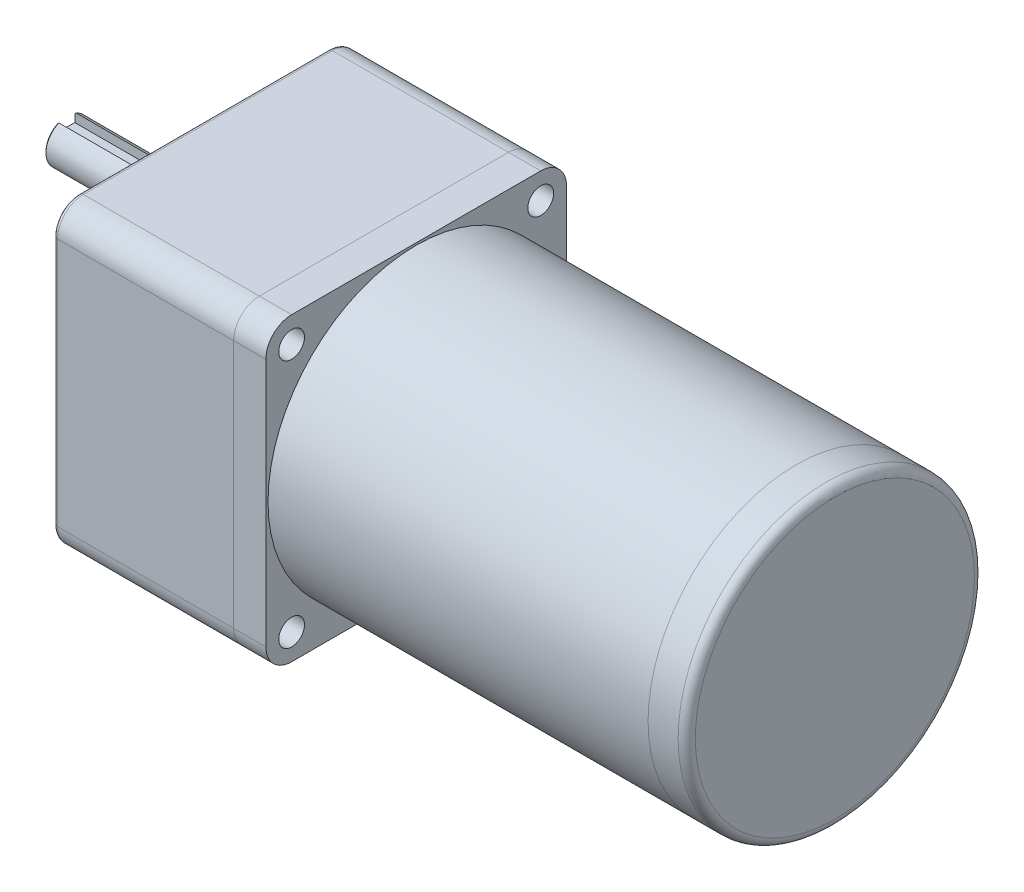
ISO-10303-21;
HEADER;
FILE_DESCRIPTION(('STEP AP214'),'2;1');
FILE_NAME('part.step','',(''),(''),'','','');
FILE_SCHEMA(('AUTOMOTIVE_DESIGN { 1 0 10303 214 1 1 1 1 }'));
ENDSEC;
DATA;
#1=APPLICATION_CONTEXT('core data for automotive mechanical design processes');
#2=APPLICATION_PROTOCOL_DEFINITION('international standard','automotive_design',2000,#1);
#3=PRODUCT_CONTEXT('',#1,'mechanical');
#4=PRODUCT('Part','Part','',(#3));
#5=PRODUCT_RELATED_PRODUCT_CATEGORY('part','',(#4));
#6=PRODUCT_DEFINITION_FORMATION('','',#4);
#7=PRODUCT_DEFINITION_CONTEXT('part definition',#1,'design');
#8=PRODUCT_DEFINITION('design','',#6,#7);
#9=PRODUCT_DEFINITION_SHAPE('','',#8);
#10=(LENGTH_UNIT() NAMED_UNIT(*) SI_UNIT(.MILLI.,.METRE.));
#11=(NAMED_UNIT(*) PLANE_ANGLE_UNIT() SI_UNIT($,.RADIAN.));
#12=(NAMED_UNIT(*) SI_UNIT($,.STERADIAN.) SOLID_ANGLE_UNIT());
#13=UNCERTAINTY_MEASURE_WITH_UNIT(LENGTH_MEASURE(1.E-05),#10,'distance_accuracy_value','');
#14=(GEOMETRIC_REPRESENTATION_CONTEXT(3) GLOBAL_UNCERTAINTY_ASSIGNED_CONTEXT((#13)) GLOBAL_UNIT_ASSIGNED_CONTEXT((#10,
#11,#12)) REPRESENTATION_CONTEXT('',''));
#15=CARTESIAN_POINT('',(0.,0.,0.));
#16=DIRECTION('',(0.,0.,1.));
#17=DIRECTION('',(1.,0.,0.));
#18=AXIS2_PLACEMENT_3D('',#15,#16,#17);
#19=CARTESIAN_POINT('',(147.,0.,0.));
#20=DIRECTION('',(-1.,0.,0.));
#21=DIRECTION('',(0.,0.,1.));
#22=AXIS2_PLACEMENT_3D('',#19,#20,#21);
#23=CYLINDRICAL_SURFACE('',#22,34.5);
#24=CARTESIAN_POINT('',(145.,0.,0.));
#25=DIRECTION('',(1.,0.,0.));
#26=DIRECTION('',(0.,0.,-1.));
#27=AXIS2_PLACEMENT_3D('',#24,#25,#26);
#28=CIRCLE('',#27,34.5);
#29=CARTESIAN_POINT('',(145.,0.,-34.5));
#30=VERTEX_POINT('',#29);
#31=EDGE_CURVE('E11',#30,#30,#28,.F.);
#32=ORIENTED_EDGE('',*,*,#31,.T.);
#33=EDGE_LOOP('',(#32));
#34=FACE_BOUND('',#33,.T.);
#35=CARTESIAN_POINT('',(138.,0.,0.));
#36=DIRECTION('',(1.,0.,0.));
#37=DIRECTION('',(0.,0.,-1.));
#38=AXIS2_PLACEMENT_3D('',#35,#36,#37);
#39=CIRCLE('',#38,34.5);
#40=CARTESIAN_POINT('',(138.,0.,-34.5));
#41=VERTEX_POINT('',#40);
#42=EDGE_CURVE('E57',#41,#41,#39,.T.);
#43=ORIENTED_EDGE('',*,*,#42,.T.);
#44=EDGE_LOOP('',(#43));
#45=FACE_BOUND('',#44,.T.);
#46=ADVANCED_FACE('F46',(#34,#45),#23,.T.);
#47=CARTESIAN_POINT('',(147.,0.,0.));
#48=DIRECTION('',(1.,0.,0.));
#49=DIRECTION('',(0.,0.,-1.));
#50=AXIS2_PLACEMENT_3D('',#47,#48,#49);
#51=PLANE('',#50);
#52=CARTESIAN_POINT('',(147.,0.,0.));
#53=DIRECTION('',(1.,0.,0.));
#54=DIRECTION('',(0.,0.,-1.));
#55=AXIS2_PLACEMENT_3D('',#52,#53,#54);
#56=CIRCLE('',#55,32.5);
#57=CARTESIAN_POINT('',(147.,0.,-32.5));
#58=VERTEX_POINT('',#57);
#59=EDGE_CURVE('E53',#58,#58,#56,.T.);
#60=ORIENTED_EDGE('',*,*,#59,.T.);
#61=EDGE_LOOP('',(#60));
#62=FACE_BOUND('',#61,.T.);
#63=ADVANCED_FACE('F67',(#62),#51,.T.);
#64=CARTESIAN_POINT('',(138.,0.,0.));
#65=DIRECTION('',(1.,0.,0.));
#66=DIRECTION('',(0.,0.,-1.));
#67=AXIS2_PLACEMENT_3D('',#64,#65,#66);
#68=PLANE('',#67);
#69=ORIENTED_EDGE('',*,*,#42,.F.);
#70=EDGE_LOOP('',(#69));
#71=FACE_BOUND('',#70,.T.);
#72=ADVANCED_FACE('F65',(#71),#68,.F.);
#73=CARTESIAN_POINT('',(145.,0.,0.));
#74=DIRECTION('',(1.,0.,0.));
#75=DIRECTION('',(0.,0.,-1.));
#76=AXIS2_PLACEMENT_3D('',#73,#74,#75);
#77=TOROIDAL_SURFACE('',#76,32.5,2.);
#78=ORIENTED_EDGE('',*,*,#31,.F.);
#79=EDGE_LOOP('',(#78));
#80=FACE_BOUND('',#79,.T.);
#81=ORIENTED_EDGE('',*,*,#59,.F.);
#82=EDGE_LOOP('',(#81));
#83=FACE_BOUND('',#82,.T.);
#84=ADVANCED_FACE('F48',(#80,#83),#77,.T.);
#85=CLOSED_SHELL('',(#46,#63,#72,#84));
#86=MANIFOLD_SOLID_BREP('B2',#85);
#87=CARTESIAN_POINT('',(138.,0.,0.));
#88=DIRECTION('',(-1.,0.,0.));
#89=DIRECTION('',(0.,0.,1.));
#90=AXIS2_PLACEMENT_3D('',#87,#88,#89);
#91=CYLINDRICAL_SURFACE('',#90,34.5);
#92=CARTESIAN_POINT('',(138.,0.,0.));
#93=DIRECTION('',(1.,0.,0.));
#94=DIRECTION('',(0.,0.,-1.));
#95=AXIS2_PLACEMENT_3D('',#92,#93,#94);
#96=CIRCLE('',#95,34.5);
#97=CARTESIAN_POINT('',(138.,0.,-34.5));
#98=VERTEX_POINT('',#97);
#99=EDGE_CURVE('E45',#98,#98,#96,.T.);
#100=ORIENTED_EDGE('',*,*,#99,.F.);
#101=EDGE_LOOP('',(#100));
#102=FACE_BOUND('',#101,.T.);
#103=CARTESIAN_POINT('',(49.5,0.,0.));
#104=DIRECTION('',(1.,0.,0.));
#105=DIRECTION('',(0.,0.,-1.));
#106=AXIS2_PLACEMENT_3D('',#103,#104,#105);
#107=CIRCLE('',#106,34.5);
#108=CARTESIAN_POINT('',(49.5,0.,-34.5));
#109=VERTEX_POINT('',#108);
#110=EDGE_CURVE('E115',#109,#109,#107,.T.);
#111=ORIENTED_EDGE('',*,*,#110,.T.);
#112=EDGE_LOOP('',(#111));
#113=FACE_BOUND('',#112,.T.);
#114=ADVANCED_FACE('F112',(#102,#113),#91,.T.);
#115=CARTESIAN_POINT('',(138.,0.,0.));
#116=DIRECTION('',(1.,0.,0.));
#117=DIRECTION('',(0.,0.,-1.));
#118=AXIS2_PLACEMENT_3D('',#115,#116,#117);
#119=PLANE('',#118);
#120=ORIENTED_EDGE('',*,*,#99,.T.);
#121=EDGE_LOOP('',(#120));
#122=FACE_BOUND('',#121,.T.);
#123=ADVANCED_FACE('F127',(#122),#119,.T.);
#124=CARTESIAN_POINT('',(49.5,0.,0.));
#125=DIRECTION('',(1.,0.,0.));
#126=DIRECTION('',(0.,0.,-1.));
#127=AXIS2_PLACEMENT_3D('',#124,#125,#126);
#128=PLANE('',#127);
#129=ORIENTED_EDGE('',*,*,#110,.F.);
#130=EDGE_LOOP('',(#129));
#131=FACE_BOUND('',#130,.T.);
#132=ADVANCED_FACE('F125',(#131),#128,.F.);
#133=CLOSED_SHELL('',(#114,#123,#132));
#134=MANIFOLD_SOLID_BREP('B6',#133);
#135=CARTESIAN_POINT('',(-32.,15.,0.));
#136=DIRECTION('',(1.,0.,0.));
#137=DIRECTION('',(0.,0.,-1.));
#138=AXIS2_PLACEMENT_3D('',#135,#136,#137);
#139=CYLINDRICAL_SURFACE('',#138,5.);
#140=DIRECTION('',(1.,0.,0.));
#141=VECTOR('',#140,1.);
#142=CARTESIAN_POINT('',(-32.,19.5825756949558,2.));
#143=LINE('',#142,#141);
#144=CARTESIAN_POINT('',(-9.,19.5825756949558,2.));
#145=VERTEX_POINT('',#144);
#146=CARTESIAN_POINT('',(-31.7,19.5825756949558,2.));
#147=VERTEX_POINT('',#146);
#148=EDGE_CURVE('E246',#145,#147,#143,.F.);
#149=ORIENTED_EDGE('',*,*,#148,.T.);
#150=CARTESIAN_POINT('',(-31.7,15.,0.));
#151=DIRECTION('',(-1.,0.,0.));
#152=DIRECTION('',(0.,0.,1.));
#153=AXIS2_PLACEMENT_3D('',#150,#151,#152);
#154=CIRCLE('',#153,5.);
#155=CARTESIAN_POINT('',(-31.7,19.5825756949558,-2.));
#156=VERTEX_POINT('',#155);
#157=EDGE_CURVE('E174',#147,#156,#154,.F.);
#158=ORIENTED_EDGE('',*,*,#157,.T.);
#159=DIRECTION('',(1.,0.,0.));
#160=VECTOR('',#159,1.);
#161=CARTESIAN_POINT('',(-32.,19.5825756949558,-2.));
#162=LINE('',#161,#160);
#163=CARTESIAN_POINT('',(-9.,19.5825756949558,-2.));
#164=VERTEX_POINT('',#163);
#165=EDGE_CURVE('E241',#156,#164,#162,.T.);
#166=ORIENTED_EDGE('',*,*,#165,.T.);
#167=CARTESIAN_POINT('',(-9.,19.5825756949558,-2.));
#168=CARTESIAN_POINT('',(-8.94619414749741,19.5825646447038,-2.00000798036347));
#169=CARTESIAN_POINT('',(-8.89239433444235,19.5835230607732,-1.99782891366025));
#170=CARTESIAN_POINT('',(-8.7852287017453,19.5872962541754,-1.98915905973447));
#171=CARTESIAN_POINT('',(-8.73186272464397,19.5901103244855,-1.98266991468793));
#172=CARTESIAN_POINT('',(-8.62615317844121,19.5974978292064,-1.9654760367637));
#173=CARTESIAN_POINT('',(-8.57380641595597,19.6020643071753,-1.95478796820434));
#174=CARTESIAN_POINT('',(-8.47029922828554,19.6128005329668,-1.92931630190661));
#175=CARTESIAN_POINT('',(-8.41913887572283,19.618970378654,-1.91453245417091));
#176=CARTESIAN_POINT('',(-8.26806414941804,19.6395929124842,-1.86426971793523));
#177=CARTESIAN_POINT('',(-8.17034576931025,19.6561744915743,-1.82284489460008));
#178=CARTESIAN_POINT('',(-7.98320441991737,19.6931237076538,-1.72548191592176));
#179=CARTESIAN_POINT('',(-7.89378944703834,19.7134949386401,-1.66952996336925));
#180=CARTESIAN_POINT('',(-7.72073760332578,19.7570099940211,-1.54131835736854));
#181=CARTESIAN_POINT('',(-7.63763278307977,19.7802424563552,-1.4683691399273));
#182=CARTESIAN_POINT('',(-7.48445972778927,19.8261279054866,-1.30969646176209));
#183=CARTESIAN_POINT('',(-7.41439416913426,19.8487807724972,-1.22397038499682));
#184=CARTESIAN_POINT('',(-7.28659360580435,19.8920341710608,-1.03800590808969));
#185=CARTESIAN_POINT('',(-7.22945519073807,19.9125182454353,-0.937327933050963));
#186=CARTESIAN_POINT('',(-7.13315592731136,19.94803944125,-0.726824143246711));
#187=CARTESIAN_POINT('',(-7.09398757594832,19.9630788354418,-0.617002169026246));
#188=CARTESIAN_POINT('',(-7.03665879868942,19.9853831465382,-0.396967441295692));
#189=CARTESIAN_POINT('',(-7.01757304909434,19.9929892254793,-0.287031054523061));
#190=CARTESIAN_POINT('',(-6.99797152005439,20.0008031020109,-0.0652684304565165));
#191=CARTESIAN_POINT('',(-6.99744916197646,20.0010135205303,0.0465571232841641));
#192=CARTESIAN_POINT('',(-7.01448283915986,19.994219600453,0.262233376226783));
#193=CARTESIAN_POINT('',(-7.03102504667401,19.9876198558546,0.36617920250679));
#194=CARTESIAN_POINT('',(-7.07999342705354,19.9684927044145,0.569674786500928));
#195=CARTESIAN_POINT('',(-7.11242049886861,19.9559649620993,0.669224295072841));
#196=CARTESIAN_POINT('',(-7.19263629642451,19.9259683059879,0.862897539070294));
#197=CARTESIAN_POINT('',(-7.24064924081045,19.9084277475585,0.956916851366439));
#198=CARTESIAN_POINT('',(-7.35046458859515,19.8701460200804,1.13580746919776));
#199=CARTESIAN_POINT('',(-7.41227182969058,19.8494037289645,1.22067554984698));
#200=CARTESIAN_POINT('',(-7.55264418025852,19.8052178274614,1.38476339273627));
#201=CARTESIAN_POINT('',(-7.63204247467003,19.7816862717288,1.46324770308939));
#202=CARTESIAN_POINT('',(-7.80298009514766,19.7356195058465,1.60609926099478));
#203=CARTESIAN_POINT('',(-7.89452492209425,19.7130847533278,1.67046007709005));
#204=CARTESIAN_POINT('',(-8.09047028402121,19.6709568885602,1.78493657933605));
#205=CARTESIAN_POINT('',(-8.1951648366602,19.6514670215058,1.83458932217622));
#206=CARTESIAN_POINT('',(-8.41236152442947,19.6188610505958,1.91521298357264));
#207=CARTESIAN_POINT('',(-8.52484944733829,19.6057336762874,1.94621696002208));
#208=CARTESIAN_POINT('',(-8.69874363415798,19.5920830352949,1.9781058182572));
#209=CARTESIAN_POINT('',(-8.75865754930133,19.5885343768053,1.98630505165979));
#210=CARTESIAN_POINT('',(-8.87903501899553,19.5837754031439,1.99725282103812));
#211=CARTESIAN_POINT('',(-8.93949821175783,19.5825636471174,2.00000471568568));
#212=CARTESIAN_POINT('',(-9.,19.5825756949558,2.));
#213=B_SPLINE_CURVE_WITH_KNOTS('',3,(#167,#168,#169,#170,#171,#172,#173,#174,#175,#176,#177,
#178,#179,#180,#181,#182,#183,#184,#185,#186,#187,#188,#189,#190,#191,#192,#193,#194,#195,#196,
#197,#198,#199,#200,#201,#202,#203,#204,#205,#206,#207,#208,#209,#210,#211,#212),.UNSPECIFIED.,
.F.,.F.,(4,2,2,2,2,2,2,2,2,2,2,2,2,2,2,2,2,2,2,2,2,2,4),(0.,0.161354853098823,0.322648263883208,
0.483307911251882,0.643977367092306,0.964683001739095,1.28569434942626,1.62318047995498,
1.96073580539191,2.31162858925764,2.66237473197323,2.9961387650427,3.32978451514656,
3.64468915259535,3.95961161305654,4.27928176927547,4.59906421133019,4.93981874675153,
5.28072813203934,5.63144241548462,5.98153315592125,6.16300192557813,6.3443587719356),.UNSPECIFIED.);
#214=EDGE_CURVE('E220',#164,#145,#213,.T.);
#215=ORIENTED_EDGE('',*,*,#214,.T.);
#216=EDGE_LOOP('',(#149,#158,#166,#215));
#217=FACE_BOUND('',#216,.T.);
#218=CARTESIAN_POINT('',(-3.,15.,0.));
#219=DIRECTION('',(-1.,0.,0.));
#220=DIRECTION('',(0.,0.,1.));
#221=AXIS2_PLACEMENT_3D('',#218,#219,#220);
#222=CIRCLE('',#221,5.);
#223=CARTESIAN_POINT('',(-3.,15.,5.));
#224=VERTEX_POINT('',#223);
#225=EDGE_CURVE('E248',#224,#224,#222,.T.);
#226=ORIENTED_EDGE('',*,*,#225,.T.);
#227=EDGE_LOOP('',(#226));
#228=FACE_BOUND('',#227,.T.);
#229=ADVANCED_FACE('F161',(#217,#228),#139,.T.);
#230=CARTESIAN_POINT('',(-32.,15.,0.));
#231=DIRECTION('',(-1.,0.,0.));
#232=DIRECTION('',(0.,0.,1.));
#233=AXIS2_PLACEMENT_3D('',#230,#231,#232);
#234=PLANE('',#233);
#235=DIRECTION('',(0.,1.,0.));
#236=VECTOR('',#235,1.);
#237=CARTESIAN_POINT('',(-32.,17.5,-2.));
#238=LINE('',#237,#236);
#239=CARTESIAN_POINT('',(-32.,17.5,-2.));
#240=VERTEX_POINT('',#239);
#241=CARTESIAN_POINT('',(-32.,19.2532340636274,-2.));
#242=VERTEX_POINT('',#241);
#243=EDGE_CURVE('E222',#240,#242,#238,.T.);
#244=ORIENTED_EDGE('',*,*,#243,.T.);
#245=CARTESIAN_POINT('',(-32.,15.,0.));
#246=DIRECTION('',(-1.,0.,0.));
#247=DIRECTION('',(0.,0.,1.));
#248=AXIS2_PLACEMENT_3D('',#245,#246,#247);
#249=CIRCLE('',#248,4.70000000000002);
#250=CARTESIAN_POINT('',(-32.,19.2532340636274,2.));
#251=VERTEX_POINT('',#250);
#252=EDGE_CURVE('E256',#242,#251,#249,.T.);
#253=ORIENTED_EDGE('',*,*,#252,.T.);
#254=DIRECTION('',(0.,1.,0.));
#255=VECTOR('',#254,1.);
#256=CARTESIAN_POINT('',(-32.,17.5,2.));
#257=LINE('',#256,#255);
#258=CARTESIAN_POINT('',(-32.,17.5,2.));
#259=VERTEX_POINT('',#258);
#260=EDGE_CURVE('E242',#259,#251,#257,.T.);
#261=ORIENTED_EDGE('',*,*,#260,.F.);
#262=DIRECTION('',(0.,0.,1.));
#263=VECTOR('',#262,1.);
#264=CARTESIAN_POINT('',(-32.,17.5,-2.));
#265=LINE('',#264,#263);
#266=EDGE_CURVE('E231',#240,#259,#265,.T.);
#267=ORIENTED_EDGE('',*,*,#266,.F.);
#268=EDGE_LOOP('',(#244,#253,#261,#267));
#269=FACE_BOUND('',#268,.T.);
#270=ADVANCED_FACE('F267',(#269),#234,.T.);
#271=CARTESIAN_POINT('',(-3.,15.,0.));
#272=DIRECTION('',(-1.,0.,0.));
#273=DIRECTION('',(0.,0.,1.));
#274=AXIS2_PLACEMENT_3D('',#271,#272,#273);
#275=PLANE('',#274);
#276=ORIENTED_EDGE('',*,*,#225,.F.);
#277=EDGE_LOOP('',(#276));
#278=FACE_BOUND('',#277,.T.);
#279=ADVANCED_FACE('F264',(#278),#275,.F.);
#280=CARTESIAN_POINT('',(-9.,17.5,0.));
#281=DIRECTION('',(0.,1.,0.));
#282=DIRECTION('',(0.,0.,1.));
#283=AXIS2_PLACEMENT_3D('',#280,#281,#282);
#284=CYLINDRICAL_SURFACE('',#283,2.);
#285=DIRECTION('',(0.,1.,0.));
#286=VECTOR('',#285,1.);
#287=CARTESIAN_POINT('',(-9.,17.5,-2.));
#288=LINE('',#287,#286);
#289=CARTESIAN_POINT('',(-9.,17.5,-2.));
#290=VERTEX_POINT('',#289);
#291=EDGE_CURVE('E212',#290,#164,#288,.T.);
#292=ORIENTED_EDGE('',*,*,#291,.F.);
#293=CARTESIAN_POINT('',(-9.,17.5,0.));
#294=DIRECTION('',(0.,1.,0.));
#295=DIRECTION('',(0.,0.,1.));
#296=AXIS2_PLACEMENT_3D('',#293,#294,#295);
#297=CIRCLE('',#296,2.);
#298=CARTESIAN_POINT('',(-9.,17.5,2.));
#299=VERTEX_POINT('',#298);
#300=EDGE_CURVE('E217',#299,#290,#297,.T.);
#301=ORIENTED_EDGE('',*,*,#300,.F.);
#302=DIRECTION('',(0.,1.,0.));
#303=VECTOR('',#302,1.);
#304=CARTESIAN_POINT('',(-9.,17.5,2.));
#305=LINE('',#304,#303);
#306=EDGE_CURVE('E239',#299,#145,#305,.T.);
#307=ORIENTED_EDGE('',*,*,#306,.T.);
#308=ORIENTED_EDGE('',*,*,#214,.F.);
#309=EDGE_LOOP('',(#292,#301,#307,#308));
#310=FACE_BOUND('',#309,.T.);
#311=ADVANCED_FACE('F214',(#310),#284,.F.);
#312=CARTESIAN_POINT('',(-32.,17.5,2.));
#313=DIRECTION('',(0.,0.,1.));
#314=DIRECTION('',(1.,0.,0.));
#315=AXIS2_PLACEMENT_3D('',#312,#313,#314);
#316=PLANE('',#315);
#317=ORIENTED_EDGE('',*,*,#260,.T.);
#318=CARTESIAN_POINT('',(-32.,19.2532340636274,2.));
#319=CARTESIAN_POINT('',(-31.950173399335,19.3082822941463,2.));
#320=CARTESIAN_POINT('',(-31.9002600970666,19.3632515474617,2.));
#321=CARTESIAN_POINT('',(-31.8002600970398,19.4730320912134,2.));
#322=CARTESIAN_POINT('',(-31.7501733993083,19.5278433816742,2.));
#323=CARTESIAN_POINT('',(-31.7,19.5825756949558,2.));
#324=B_SPLINE_CURVE_WITH_KNOTS('',3,(#318,#319,#320,#321,#322,#323),.UNSPECIFIED.,.F.,.F.,(4,2,
4),(0.,0.22274785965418,0.445495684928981),.UNSPECIFIED.);
#325=EDGE_CURVE('E188',#251,#147,#324,.T.);
#326=ORIENTED_EDGE('',*,*,#325,.T.);
#327=ORIENTED_EDGE('',*,*,#148,.F.);
#328=ORIENTED_EDGE('',*,*,#306,.F.);
#329=DIRECTION('',(1.,0.,0.));
#330=VECTOR('',#329,1.);
#331=CARTESIAN_POINT('',(-32.,17.5,2.));
#332=LINE('',#331,#330);
#333=EDGE_CURVE('E223',#259,#299,#332,.T.);
#334=ORIENTED_EDGE('',*,*,#333,.F.);
#335=EDGE_LOOP('',(#317,#326,#327,#328,#334));
#336=FACE_BOUND('',#335,.T.);
#337=ADVANCED_FACE('F263',(#336),#316,.F.);
#338=CARTESIAN_POINT('',(-9.,17.5,-2.));
#339=DIRECTION('',(0.,0.,-1.));
#340=DIRECTION('',(-1.,0.,0.));
#341=AXIS2_PLACEMENT_3D('',#338,#339,#340);
#342=PLANE('',#341);
#343=ORIENTED_EDGE('',*,*,#165,.F.);
#344=CARTESIAN_POINT('',(-31.7,19.5825756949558,-2.));
#345=CARTESIAN_POINT('',(-31.7501733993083,19.5278433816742,-2.));
#346=CARTESIAN_POINT('',(-31.8002600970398,19.4730320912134,-2.));
#347=CARTESIAN_POINT('',(-31.9002600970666,19.3632515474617,-2.));
#348=CARTESIAN_POINT('',(-31.950173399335,19.3082822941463,-2.));
#349=CARTESIAN_POINT('',(-32.,19.2532340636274,-2.));
#350=B_SPLINE_CURVE_WITH_KNOTS('',3,(#344,#345,#346,#347,#348,#349),.UNSPECIFIED.,.F.,.F.,(4,2,
4),(0.,0.2227478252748,0.445495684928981),.UNSPECIFIED.);
#351=EDGE_CURVE('E110',#156,#242,#350,.T.);
#352=ORIENTED_EDGE('',*,*,#351,.T.);
#353=ORIENTED_EDGE('',*,*,#243,.F.);
#354=DIRECTION('',(-1.,0.,0.));
#355=VECTOR('',#354,1.);
#356=CARTESIAN_POINT('',(-9.,17.5,-2.));
#357=LINE('',#356,#355);
#358=EDGE_CURVE('E226',#290,#240,#357,.T.);
#359=ORIENTED_EDGE('',*,*,#358,.F.);
#360=ORIENTED_EDGE('',*,*,#291,.T.);
#361=EDGE_LOOP('',(#343,#352,#353,#359,#360));
#362=FACE_BOUND('',#361,.T.);
#363=ADVANCED_FACE('F227',(#362),#342,.F.);
#364=CARTESIAN_POINT('',(-9.,17.5,0.));
#365=DIRECTION('',(0.,1.,0.));
#366=DIRECTION('',(0.,0.,1.));
#367=AXIS2_PLACEMENT_3D('',#364,#365,#366);
#368=PLANE('',#367);
#369=ORIENTED_EDGE('',*,*,#300,.T.);
#370=ORIENTED_EDGE('',*,*,#358,.T.);
#371=ORIENTED_EDGE('',*,*,#266,.T.);
#372=ORIENTED_EDGE('',*,*,#333,.T.);
#373=EDGE_LOOP('',(#369,#370,#371,#372));
#374=FACE_BOUND('',#373,.T.);
#375=ADVANCED_FACE('F233',(#374),#368,.T.);
#376=CARTESIAN_POINT('',(-32.,15.,0.));
#377=DIRECTION('',(1.,0.,0.));
#378=DIRECTION('',(0.,0.,-1.));
#379=AXIS2_PLACEMENT_3D('',#376,#377,#378);
#380=CONICAL_SURFACE('',#379,4.70000000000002,0.78539816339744);
#381=ORIENTED_EDGE('',*,*,#351,.F.);
#382=ORIENTED_EDGE('',*,*,#157,.F.);
#383=ORIENTED_EDGE('',*,*,#325,.F.);
#384=ORIENTED_EDGE('',*,*,#252,.F.);
#385=EDGE_LOOP('',(#381,#382,#383,#384));
#386=FACE_BOUND('',#385,.T.);
#387=ADVANCED_FACE('F163',(#386),#380,.T.);
#388=CLOSED_SHELL('',(#229,#270,#279,#311,#337,#363,#375,#387));
#389=MANIFOLD_SOLID_BREP('B40',#388);
#390=CARTESIAN_POINT('',(-3.,15.,0.));
#391=DIRECTION('',(1.,0.,0.));
#392=DIRECTION('',(0.,0.,-1.));
#393=AXIS2_PLACEMENT_3D('',#390,#391,#392);
#394=CYLINDRICAL_SURFACE('',#393,12.);
#395=CARTESIAN_POINT('',(-2.5,15.,0.));
#396=DIRECTION('',(-1.,0.,0.));
#397=DIRECTION('',(0.,0.,1.));
#398=AXIS2_PLACEMENT_3D('',#395,#396,#397);
#399=CIRCLE('',#398,12.);
#400=CARTESIAN_POINT('',(-2.5,15.,12.));
#401=VERTEX_POINT('',#400);
#402=EDGE_CURVE('E160',#401,#401,#399,.F.);
#403=ORIENTED_EDGE('',*,*,#402,.T.);
#404=EDGE_LOOP('',(#403));
#405=FACE_BOUND('',#404,.T.);
#406=CARTESIAN_POINT('',(0.,15.,0.));
#407=DIRECTION('',(-1.,0.,0.));
#408=DIRECTION('',(0.,0.,1.));
#409=AXIS2_PLACEMENT_3D('',#406,#407,#408);
#410=CIRCLE('',#409,12.);
#411=CARTESIAN_POINT('',(0.,15.,12.));
#412=VERTEX_POINT('',#411);
#413=EDGE_CURVE('E362',#412,#412,#410,.T.);
#414=ORIENTED_EDGE('',*,*,#413,.T.);
#415=EDGE_LOOP('',(#414));
#416=FACE_BOUND('',#415,.T.);
#417=ADVANCED_FACE('F351',(#405,#416),#394,.T.);
#418=CARTESIAN_POINT('',(-3.,15.,0.));
#419=DIRECTION('',(-1.,0.,0.));
#420=DIRECTION('',(0.,0.,1.));
#421=AXIS2_PLACEMENT_3D('',#418,#419,#420);
#422=PLANE('',#421);
#423=CARTESIAN_POINT('',(-3.,15.,0.));
#424=DIRECTION('',(-1.,0.,0.));
#425=DIRECTION('',(0.,0.,1.));
#426=AXIS2_PLACEMENT_3D('',#423,#424,#425);
#427=CIRCLE('',#426,11.5);
#428=CARTESIAN_POINT('',(-3.,15.,11.5));
#429=VERTEX_POINT('',#428);
#430=EDGE_CURVE('E358',#429,#429,#427,.T.);
#431=ORIENTED_EDGE('',*,*,#430,.T.);
#432=EDGE_LOOP('',(#431));
#433=FACE_BOUND('',#432,.T.);
#434=ADVANCED_FACE('F372',(#433),#422,.T.);
#435=CARTESIAN_POINT('',(0.,15.,0.));
#436=DIRECTION('',(-1.,0.,0.));
#437=DIRECTION('',(0.,0.,1.));
#438=AXIS2_PLACEMENT_3D('',#435,#436,#437);
#439=PLANE('',#438);
#440=ORIENTED_EDGE('',*,*,#413,.F.);
#441=EDGE_LOOP('',(#440));
#442=FACE_BOUND('',#441,.T.);
#443=ADVANCED_FACE('F370',(#442),#439,.F.);
#444=CARTESIAN_POINT('',(-2.5,15.,0.));
#445=DIRECTION('',(-1.,0.,0.));
#446=DIRECTION('',(0.,0.,1.));
#447=AXIS2_PLACEMENT_3D('',#444,#445,#446);
#448=TOROIDAL_SURFACE('',#447,11.5,0.5);
#449=ORIENTED_EDGE('',*,*,#402,.F.);
#450=EDGE_LOOP('',(#449));
#451=FACE_BOUND('',#450,.T.);
#452=ORIENTED_EDGE('',*,*,#430,.F.);
#453=EDGE_LOOP('',(#452));
#454=FACE_BOUND('',#453,.T.);
#455=ADVANCED_FACE('F353',(#451,#454),#448,.T.);
#456=CLOSED_SHELL('',(#417,#434,#443,#455));
#457=MANIFOLD_SOLID_BREP('B104',#456);
#458=CARTESIAN_POINT('',(49.5,29.,-29.));
#459=DIRECTION('',(-1.,0.,0.));
#460=DIRECTION('',(0.,0.,1.));
#461=AXIS2_PLACEMENT_3D('',#458,#459,#460);
#462=CYLINDRICAL_SURFACE('',#461,6.);
#463=CARTESIAN_POINT('',(42.,29.,-29.));
#464=DIRECTION('',(1.,0.,0.));
#465=DIRECTION('',(0.,0.,1.));
#466=AXIS2_PLACEMENT_3D('',#463,#464,#465);
#467=CIRCLE('',#466,6.);
#468=CARTESIAN_POINT('',(42.,29.,-35.));
#469=VERTEX_POINT('',#468);
#470=CARTESIAN_POINT('',(42.,35.,-29.));
#471=VERTEX_POINT('',#470);
#472=EDGE_CURVE('E514',#469,#471,#467,.T.);
#473=ORIENTED_EDGE('',*,*,#472,.T.);
#474=DIRECTION('',(-1.,0.,0.));
#475=VECTOR('',#474,1.);
#476=CARTESIAN_POINT('',(49.5,35.,-29.));
#477=LINE('',#476,#475);
#478=CARTESIAN_POINT('',(49.5,35.,-29.));
#479=VERTEX_POINT('',#478);
#480=EDGE_CURVE('E349',#479,#471,#477,.T.);
#481=ORIENTED_EDGE('',*,*,#480,.F.);
#482=CARTESIAN_POINT('',(49.5,29.,-29.));
#483=DIRECTION('',(1.,0.,0.));
#484=DIRECTION('',(0.,0.,1.));
#485=AXIS2_PLACEMENT_3D('',#482,#483,#484);
#486=CIRCLE('',#485,6.);
#487=CARTESIAN_POINT('',(49.5,29.,-35.));
#488=VERTEX_POINT('',#487);
#489=EDGE_CURVE('E528',#488,#479,#486,.T.);
#490=ORIENTED_EDGE('',*,*,#489,.F.);
#491=DIRECTION('',(-1.,0.,0.));
#492=VECTOR('',#491,1.);
#493=CARTESIAN_POINT('',(49.5,29.,-35.));
#494=LINE('',#493,#492);
#495=EDGE_CURVE('E510',#488,#469,#494,.T.);
#496=ORIENTED_EDGE('',*,*,#495,.T.);
#497=EDGE_LOOP('',(#473,#481,#490,#496));
#498=FACE_BOUND('',#497,.T.);
#499=ADVANCED_FACE('F416',(#498),#462,.T.);
#500=CARTESIAN_POINT('',(49.5,35.,29.));
#501=DIRECTION('',(0.,-1.,0.));
#502=DIRECTION('',(0.,0.,-1.));
#503=AXIS2_PLACEMENT_3D('',#500,#501,#502);
#504=PLANE('',#503);
#505=DIRECTION('',(0.,0.,1.));
#506=VECTOR('',#505,1.);
#507=CARTESIAN_POINT('',(42.,35.,29.));
#508=LINE('',#507,#506);
#509=CARTESIAN_POINT('',(42.,35.,29.));
#510=VERTEX_POINT('',#509);
#511=EDGE_CURVE('E517',#471,#510,#508,.T.);
#512=ORIENTED_EDGE('',*,*,#511,.T.);
#513=DIRECTION('',(-1.,0.,0.));
#514=VECTOR('',#513,1.);
#515=CARTESIAN_POINT('',(49.5,35.,29.));
#516=LINE('',#515,#514);
#517=CARTESIAN_POINT('',(49.5,35.,29.));
#518=VERTEX_POINT('',#517);
#519=EDGE_CURVE('E425',#518,#510,#516,.T.);
#520=ORIENTED_EDGE('',*,*,#519,.F.);
#521=DIRECTION('',(0.,0.,1.));
#522=VECTOR('',#521,1.);
#523=CARTESIAN_POINT('',(49.5,35.,29.));
#524=LINE('',#523,#522);
#525=EDGE_CURVE('E477',#479,#518,#524,.T.);
#526=ORIENTED_EDGE('',*,*,#525,.F.);
#527=ORIENTED_EDGE('',*,*,#480,.T.);
#528=EDGE_LOOP('',(#512,#520,#526,#527));
#529=FACE_BOUND('',#528,.T.);
#530=ADVANCED_FACE('F582',(#529),#504,.F.);
#531=CARTESIAN_POINT('',(49.5,29.,29.));
#532=DIRECTION('',(-1.,0.,0.));
#533=DIRECTION('',(0.,0.,1.));
#534=AXIS2_PLACEMENT_3D('',#531,#532,#533);
#535=CYLINDRICAL_SURFACE('',#534,6.);
#536=CARTESIAN_POINT('',(42.,29.,29.));
#537=DIRECTION('',(1.,0.,0.));
#538=DIRECTION('',(0.,0.,1.));
#539=AXIS2_PLACEMENT_3D('',#536,#537,#538);
#540=CIRCLE('',#539,6.);
#541=CARTESIAN_POINT('',(42.,29.,35.));
#542=VERTEX_POINT('',#541);
#543=EDGE_CURVE('E519',#510,#542,#540,.T.);
#544=ORIENTED_EDGE('',*,*,#543,.T.);
#545=DIRECTION('',(-1.,0.,0.));
#546=VECTOR('',#545,1.);
#547=CARTESIAN_POINT('',(49.5,29.,35.));
#548=LINE('',#547,#546);
#549=CARTESIAN_POINT('',(49.5,29.,35.));
#550=VERTEX_POINT('',#549);
#551=EDGE_CURVE('E535',#550,#542,#548,.T.);
#552=ORIENTED_EDGE('',*,*,#551,.F.);
#553=CARTESIAN_POINT('',(49.5,29.,29.));
#554=DIRECTION('',(1.,0.,0.));
#555=DIRECTION('',(0.,0.,1.));
#556=AXIS2_PLACEMENT_3D('',#553,#554,#555);
#557=CIRCLE('',#556,6.);
#558=EDGE_CURVE('E683',#518,#550,#557,.T.);
#559=ORIENTED_EDGE('',*,*,#558,.F.);
#560=ORIENTED_EDGE('',*,*,#519,.T.);
#561=EDGE_LOOP('',(#544,#552,#559,#560));
#562=FACE_BOUND('',#561,.T.);
#563=ADVANCED_FACE('F586',(#562),#535,.T.);
#564=CARTESIAN_POINT('',(49.5,-29.,35.));
#565=DIRECTION('',(0.,0.,-1.));
#566=DIRECTION('',(-1.,0.,0.));
#567=AXIS2_PLACEMENT_3D('',#564,#565,#566);
#568=PLANE('',#567);
#569=DIRECTION('',(0.,-1.,0.));
#570=VECTOR('',#569,1.);
#571=CARTESIAN_POINT('',(42.,-29.,35.));
#572=LINE('',#571,#570);
#573=CARTESIAN_POINT('',(42.,-29.,35.));
#574=VERTEX_POINT('',#573);
#575=EDGE_CURVE('E521',#542,#574,#572,.T.);
#576=ORIENTED_EDGE('',*,*,#575,.T.);
#577=DIRECTION('',(-1.,0.,0.));
#578=VECTOR('',#577,1.);
#579=CARTESIAN_POINT('',(49.5,-29.,35.));
#580=LINE('',#579,#578);
#581=CARTESIAN_POINT('',(49.5,-29.,35.));
#582=VERTEX_POINT('',#581);
#583=EDGE_CURVE('E532',#582,#574,#580,.T.);
#584=ORIENTED_EDGE('',*,*,#583,.F.);
#585=DIRECTION('',(0.,-1.,0.));
#586=VECTOR('',#585,1.);
#587=CARTESIAN_POINT('',(49.5,-29.,35.));
#588=LINE('',#587,#586);
#589=EDGE_CURVE('E685',#550,#582,#588,.T.);
#590=ORIENTED_EDGE('',*,*,#589,.F.);
#591=ORIENTED_EDGE('',*,*,#551,.T.);
#592=EDGE_LOOP('',(#576,#584,#590,#591));
#593=FACE_BOUND('',#592,.T.);
#594=ADVANCED_FACE('F590',(#593),#568,.F.);
#595=CARTESIAN_POINT('',(49.5,-29.,29.));
#596=DIRECTION('',(-1.,0.,0.));
#597=DIRECTION('',(0.,0.,1.));
#598=AXIS2_PLACEMENT_3D('',#595,#596,#597);
#599=CYLINDRICAL_SURFACE('',#598,6.);
#600=CARTESIAN_POINT('',(42.,-29.,29.));
#601=DIRECTION('',(1.,0.,0.));
#602=DIRECTION('',(0.,0.,1.));
#603=AXIS2_PLACEMENT_3D('',#600,#601,#602);
#604=CIRCLE('',#603,6.);
#605=CARTESIAN_POINT('',(42.,-35.,29.));
#606=VERTEX_POINT('',#605);
#607=EDGE_CURVE('E523',#574,#606,#604,.T.);
#608=ORIENTED_EDGE('',*,*,#607,.T.);
#609=DIRECTION('',(-1.,0.,0.));
#610=VECTOR('',#609,1.);
#611=CARTESIAN_POINT('',(49.5,-35.,29.));
#612=LINE('',#611,#610);
#613=CARTESIAN_POINT('',(49.5,-35.,29.));
#614=VERTEX_POINT('',#613);
#615=EDGE_CURVE('E505',#614,#606,#612,.T.);
#616=ORIENTED_EDGE('',*,*,#615,.F.);
#617=CARTESIAN_POINT('',(49.5,-29.,29.));
#618=DIRECTION('',(1.,0.,0.));
#619=DIRECTION('',(0.,0.,1.));
#620=AXIS2_PLACEMENT_3D('',#617,#618,#619);
#621=CIRCLE('',#620,6.);
#622=EDGE_CURVE('E496',#582,#614,#621,.T.);
#623=ORIENTED_EDGE('',*,*,#622,.F.);
#624=ORIENTED_EDGE('',*,*,#583,.T.);
#625=EDGE_LOOP('',(#608,#616,#623,#624));
#626=FACE_BOUND('',#625,.T.);
#627=ADVANCED_FACE('F596',(#626),#599,.T.);
#628=CARTESIAN_POINT('',(49.5,-35.,29.));
#629=DIRECTION('',(0.,1.,0.));
#630=DIRECTION('',(0.,0.,1.));
#631=AXIS2_PLACEMENT_3D('',#628,#629,#630);
#632=PLANE('',#631);
#633=DIRECTION('',(0.,0.,-1.));
#634=VECTOR('',#633,1.);
#635=CARTESIAN_POINT('',(42.,-35.,29.));
#636=LINE('',#635,#634);
#637=CARTESIAN_POINT('',(42.,-35.,-29.));
#638=VERTEX_POINT('',#637);
#639=EDGE_CURVE('E504',#606,#638,#636,.T.);
#640=ORIENTED_EDGE('',*,*,#639,.T.);
#641=DIRECTION('',(-1.,0.,0.));
#642=VECTOR('',#641,1.);
#643=CARTESIAN_POINT('',(49.5,-35.,-29.));
#644=LINE('',#643,#642);
#645=CARTESIAN_POINT('',(49.5,-35.,-29.));
#646=VERTEX_POINT('',#645);
#647=EDGE_CURVE('E501',#646,#638,#644,.T.);
#648=ORIENTED_EDGE('',*,*,#647,.F.);
#649=DIRECTION('',(0.,0.,-1.));
#650=VECTOR('',#649,1.);
#651=CARTESIAN_POINT('',(49.5,-35.,29.));
#652=LINE('',#651,#650);
#653=EDGE_CURVE('E490',#614,#646,#652,.T.);
#654=ORIENTED_EDGE('',*,*,#653,.F.);
#655=ORIENTED_EDGE('',*,*,#615,.T.);
#656=EDGE_LOOP('',(#640,#648,#654,#655));
#657=FACE_BOUND('',#656,.T.);
#658=ADVANCED_FACE('F502',(#657),#632,.F.);
#659=CARTESIAN_POINT('',(49.5,-29.,-29.));
#660=DIRECTION('',(-1.,0.,0.));
#661=DIRECTION('',(0.,0.,1.));
#662=AXIS2_PLACEMENT_3D('',#659,#660,#661);
#663=CYLINDRICAL_SURFACE('',#662,6.);
#664=CARTESIAN_POINT('',(42.,-29.,-29.));
#665=DIRECTION('',(1.,0.,0.));
#666=DIRECTION('',(0.,0.,-1.));
#667=AXIS2_PLACEMENT_3D('',#664,#665,#666);
#668=CIRCLE('',#667,6.);
#669=CARTESIAN_POINT('',(42.,-29.,-35.));
#670=VERTEX_POINT('',#669);
#671=EDGE_CURVE('E463',#638,#670,#668,.T.);
#672=ORIENTED_EDGE('',*,*,#671,.T.);
#673=DIRECTION('',(-1.,0.,0.));
#674=VECTOR('',#673,1.);
#675=CARTESIAN_POINT('',(49.5,-29.,-35.));
#676=LINE('',#675,#674);
#677=CARTESIAN_POINT('',(49.5,-29.,-35.));
#678=VERTEX_POINT('',#677);
#679=EDGE_CURVE('E506',#678,#670,#676,.T.);
#680=ORIENTED_EDGE('',*,*,#679,.F.);
#681=CARTESIAN_POINT('',(49.5,-29.,-29.));
#682=DIRECTION('',(1.,0.,0.));
#683=DIRECTION('',(0.,0.,-1.));
#684=AXIS2_PLACEMENT_3D('',#681,#682,#683);
#685=CIRCLE('',#684,6.);
#686=EDGE_CURVE('E494',#646,#678,#685,.T.);
#687=ORIENTED_EDGE('',*,*,#686,.F.);
#688=ORIENTED_EDGE('',*,*,#647,.T.);
#689=EDGE_LOOP('',(#672,#680,#687,#688));
#690=FACE_BOUND('',#689,.T.);
#691=ADVANCED_FACE('F508',(#690),#663,.T.);
#692=CARTESIAN_POINT('',(49.5,-29.,-35.));
#693=DIRECTION('',(0.,0.,1.));
#694=DIRECTION('',(1.,0.,0.));
#695=AXIS2_PLACEMENT_3D('',#692,#693,#694);
#696=PLANE('',#695);
#697=DIRECTION('',(0.,1.,0.));
#698=VECTOR('',#697,1.);
#699=CARTESIAN_POINT('',(42.,-29.,-35.));
#700=LINE('',#699,#698);
#701=EDGE_CURVE('E469',#670,#469,#700,.T.);
#702=ORIENTED_EDGE('',*,*,#701,.T.);
#703=ORIENTED_EDGE('',*,*,#495,.F.);
#704=DIRECTION('',(0.,1.,0.));
#705=VECTOR('',#704,1.);
#706=CARTESIAN_POINT('',(49.5,-29.,-35.));
#707=LINE('',#706,#705);
#708=EDGE_CURVE('E434',#678,#488,#707,.T.);
#709=ORIENTED_EDGE('',*,*,#708,.F.);
#710=ORIENTED_EDGE('',*,*,#679,.T.);
#711=EDGE_LOOP('',(#702,#703,#709,#710));
#712=FACE_BOUND('',#711,.T.);
#713=ADVANCED_FACE('F571',(#712),#696,.F.);
#714=CARTESIAN_POINT('',(49.5,29.,-29.));
#715=DIRECTION('',(-1.,0.,0.));
#716=DIRECTION('',(0.,0.,1.));
#717=AXIS2_PLACEMENT_3D('',#714,#715,#716);
#718=PLANE('',#717);
#719=CARTESIAN_POINT('',(49.5,29.,29.));
#720=DIRECTION('',(1.,0.,0.));
#721=DIRECTION('',(0.,0.,-1.));
#722=AXIS2_PLACEMENT_3D('',#719,#720,#721);
#723=CIRCLE('',#722,3.);
#724=CARTESIAN_POINT('',(49.5,29.,26.));
#725=VERTEX_POINT('',#724);
#726=EDGE_CURVE('E544',#725,#725,#723,.T.);
#727=ORIENTED_EDGE('',*,*,#726,.F.);
#728=EDGE_LOOP('',(#727));
#729=FACE_BOUND('',#728,.T.);
#730=CARTESIAN_POINT('',(49.5,29.,-29.));
#731=DIRECTION('',(1.,0.,0.));
#732=DIRECTION('',(0.,0.,-1.));
#733=AXIS2_PLACEMENT_3D('',#730,#731,#732);
#734=CIRCLE('',#733,3.);
#735=CARTESIAN_POINT('',(49.5,29.,-32.));
#736=VERTEX_POINT('',#735);
#737=EDGE_CURVE('E669',#736,#736,#734,.T.);
#738=ORIENTED_EDGE('',*,*,#737,.F.);
#739=EDGE_LOOP('',(#738));
#740=FACE_BOUND('',#739,.T.);
#741=CARTESIAN_POINT('',(49.5,-29.,-29.));
#742=DIRECTION('',(1.,0.,0.));
#743=DIRECTION('',(0.,0.,-1.));
#744=AXIS2_PLACEMENT_3D('',#741,#742,#743);
#745=CIRCLE('',#744,3.);
#746=CARTESIAN_POINT('',(49.5,-29.,-32.));
#747=VERTEX_POINT('',#746);
#748=EDGE_CURVE('E671',#747,#747,#745,.T.);
#749=ORIENTED_EDGE('',*,*,#748,.F.);
#750=EDGE_LOOP('',(#749));
#751=FACE_BOUND('',#750,.T.);
#752=CARTESIAN_POINT('',(49.5,-29.,29.));
#753=DIRECTION('',(1.,0.,0.));
#754=DIRECTION('',(0.,0.,-1.));
#755=AXIS2_PLACEMENT_3D('',#752,#753,#754);
#756=CIRCLE('',#755,3.);
#757=CARTESIAN_POINT('',(49.5,-29.,26.));
#758=VERTEX_POINT('',#757);
#759=EDGE_CURVE('E676',#758,#758,#756,.T.);
#760=ORIENTED_EDGE('',*,*,#759,.F.);
#761=EDGE_LOOP('',(#760));
#762=FACE_BOUND('',#761,.T.);
#763=ORIENTED_EDGE('',*,*,#489,.T.);
#764=ORIENTED_EDGE('',*,*,#525,.T.);
#765=ORIENTED_EDGE('',*,*,#558,.T.);
#766=ORIENTED_EDGE('',*,*,#589,.T.);
#767=ORIENTED_EDGE('',*,*,#622,.T.);
#768=ORIENTED_EDGE('',*,*,#653,.T.);
#769=ORIENTED_EDGE('',*,*,#686,.T.);
#770=ORIENTED_EDGE('',*,*,#708,.T.);
#771=EDGE_LOOP('',(#763,#764,#765,#766,#767,#768,#769,#770));
#772=FACE_BOUND('',#771,.T.);
#773=ADVANCED_FACE('F492',(#729,#740,#751,#762,#772),#718,.F.);
#774=CARTESIAN_POINT('',(42.,29.,-29.));
#775=DIRECTION('',(-1.,0.,0.));
#776=DIRECTION('',(0.,0.,1.));
#777=AXIS2_PLACEMENT_3D('',#774,#775,#776);
#778=PLANE('',#777);
#779=CARTESIAN_POINT('',(42.,29.,29.));
#780=DIRECTION('',(-1.,0.,0.));
#781=DIRECTION('',(0.,0.,1.));
#782=AXIS2_PLACEMENT_3D('',#779,#780,#781);
#783=CIRCLE('',#782,3.);
#784=CARTESIAN_POINT('',(42.,29.,32.));
#785=VERTEX_POINT('',#784);
#786=EDGE_CURVE('E419',#785,#785,#783,.T.);
#787=ORIENTED_EDGE('',*,*,#786,.F.);
#788=EDGE_LOOP('',(#787));
#789=FACE_BOUND('',#788,.T.);
#790=CARTESIAN_POINT('',(42.,29.,-29.));
#791=DIRECTION('',(-1.,0.,0.));
#792=DIRECTION('',(0.,0.,1.));
#793=AXIS2_PLACEMENT_3D('',#790,#791,#792);
#794=CIRCLE('',#793,3.);
#795=CARTESIAN_POINT('',(42.,29.,-26.));
#796=VERTEX_POINT('',#795);
#797=EDGE_CURVE('E546',#796,#796,#794,.T.);
#798=ORIENTED_EDGE('',*,*,#797,.F.);
#799=EDGE_LOOP('',(#798));
#800=FACE_BOUND('',#799,.T.);
#801=CARTESIAN_POINT('',(42.,-29.,-29.));
#802=DIRECTION('',(-1.,0.,0.));
#803=DIRECTION('',(0.,0.,1.));
#804=AXIS2_PLACEMENT_3D('',#801,#802,#803);
#805=CIRCLE('',#804,3.);
#806=CARTESIAN_POINT('',(42.,-29.,-26.));
#807=VERTEX_POINT('',#806);
#808=EDGE_CURVE('E543',#807,#807,#805,.T.);
#809=ORIENTED_EDGE('',*,*,#808,.F.);
#810=EDGE_LOOP('',(#809));
#811=FACE_BOUND('',#810,.T.);
#812=CARTESIAN_POINT('',(42.,-29.,29.));
#813=DIRECTION('',(-1.,0.,0.));
#814=DIRECTION('',(0.,0.,1.));
#815=AXIS2_PLACEMENT_3D('',#812,#813,#814);
#816=CIRCLE('',#815,3.);
#817=CARTESIAN_POINT('',(42.,-29.,32.));
#818=VERTEX_POINT('',#817);
#819=EDGE_CURVE('E540',#818,#818,#816,.T.);
#820=ORIENTED_EDGE('',*,*,#819,.F.);
#821=EDGE_LOOP('',(#820));
#822=FACE_BOUND('',#821,.T.);
#823=ORIENTED_EDGE('',*,*,#472,.F.);
#824=ORIENTED_EDGE('',*,*,#701,.F.);
#825=ORIENTED_EDGE('',*,*,#671,.F.);
#826=ORIENTED_EDGE('',*,*,#639,.F.);
#827=ORIENTED_EDGE('',*,*,#607,.F.);
#828=ORIENTED_EDGE('',*,*,#575,.F.);
#829=ORIENTED_EDGE('',*,*,#543,.F.);
#830=ORIENTED_EDGE('',*,*,#511,.F.);
#831=EDGE_LOOP('',(#823,#824,#825,#826,#827,#828,#829,#830));
#832=FACE_BOUND('',#831,.T.);
#833=ADVANCED_FACE('F556',(#789,#800,#811,#822,#832),#778,.T.);
#834=CARTESIAN_POINT('',(14.,-29.,29.));
#835=DIRECTION('',(1.,0.,0.));
#836=DIRECTION('',(0.,0.,-1.));
#837=AXIS2_PLACEMENT_3D('',#834,#835,#836);
#838=CYLINDRICAL_SURFACE('',#837,3.);
#839=ORIENTED_EDGE('',*,*,#819,.T.);
#840=EDGE_LOOP('',(#839));
#841=FACE_BOUND('',#840,.T.);
#842=ORIENTED_EDGE('',*,*,#759,.T.);
#843=EDGE_LOOP('',(#842));
#844=FACE_BOUND('',#843,.T.);
#845=ADVANCED_FACE('F559',(#841,#844),#838,.F.);
#846=CARTESIAN_POINT('',(14.,-29.,-29.));
#847=DIRECTION('',(1.,0.,0.));
#848=DIRECTION('',(0.,0.,-1.));
#849=AXIS2_PLACEMENT_3D('',#846,#847,#848);
#850=CYLINDRICAL_SURFACE('',#849,3.);
#851=ORIENTED_EDGE('',*,*,#808,.T.);
#852=EDGE_LOOP('',(#851));
#853=FACE_BOUND('',#852,.T.);
#854=ORIENTED_EDGE('',*,*,#748,.T.);
#855=EDGE_LOOP('',(#854));
#856=FACE_BOUND('',#855,.T.);
#857=ADVANCED_FACE('F635',(#853,#856),#850,.F.);
#858=CARTESIAN_POINT('',(14.,29.,-29.));
#859=DIRECTION('',(1.,0.,0.));
#860=DIRECTION('',(0.,0.,-1.));
#861=AXIS2_PLACEMENT_3D('',#858,#859,#860);
#862=CYLINDRICAL_SURFACE('',#861,3.);
#863=ORIENTED_EDGE('',*,*,#797,.T.);
#864=EDGE_LOOP('',(#863));
#865=FACE_BOUND('',#864,.T.);
#866=ORIENTED_EDGE('',*,*,#737,.T.);
#867=EDGE_LOOP('',(#866));
#868=FACE_BOUND('',#867,.T.);
#869=ADVANCED_FACE('F645',(#865,#868),#862,.F.);
#870=CARTESIAN_POINT('',(14.,29.,29.));
#871=DIRECTION('',(1.,0.,0.));
#872=DIRECTION('',(0.,0.,-1.));
#873=AXIS2_PLACEMENT_3D('',#870,#871,#872);
#874=CYLINDRICAL_SURFACE('',#873,3.);
#875=ORIENTED_EDGE('',*,*,#786,.T.);
#876=EDGE_LOOP('',(#875));
#877=FACE_BOUND('',#876,.T.);
#878=ORIENTED_EDGE('',*,*,#726,.T.);
#879=EDGE_LOOP('',(#878));
#880=FACE_BOUND('',#879,.T.);
#881=ADVANCED_FACE('F553',(#877,#880),#874,.F.);
#882=CLOSED_SHELL('',(#499,#530,#563,#594,#627,#658,#691,#713,#773,#833,#845,#857,#869,#881));
#883=MANIFOLD_SOLID_BREP('B155',#882);
#884=CARTESIAN_POINT('',(42.,-29.,29.));
#885=DIRECTION('',(-1.,0.,0.));
#886=DIRECTION('',(0.,0.,1.));
#887=AXIS2_PLACEMENT_3D('',#884,#885,#886);
#888=CYLINDRICAL_SURFACE('',#887,6.);
#889=DIRECTION('',(-1.,0.,0.));
#890=VECTOR('',#889,1.);
#891=CARTESIAN_POINT('',(42.,-29.,35.));
#892=LINE('',#891,#890);
#893=CARTESIAN_POINT('',(42.,-29.,35.));
#894=VERTEX_POINT('',#893);
#895=CARTESIAN_POINT('',(1.00000000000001,-29.,35.));
#896=VERTEX_POINT('',#895);
#897=EDGE_CURVE('E937',#894,#896,#892,.T.);
#898=ORIENTED_EDGE('',*,*,#897,.T.);
#899=CARTESIAN_POINT('',(1.,-29.,29.));
#900=DIRECTION('',(-1.,0.,0.));
#901=DIRECTION('',(0.,0.,1.));
#902=AXIS2_PLACEMENT_3D('',#899,#900,#901);
#903=CIRCLE('',#902,6.);
#904=CARTESIAN_POINT('',(1.00000000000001,-35.,29.));
#905=VERTEX_POINT('',#904);
#906=EDGE_CURVE('E414',#896,#905,#903,.F.);
#907=ORIENTED_EDGE('',*,*,#906,.T.);
#908=DIRECTION('',(-1.,0.,0.));
#909=VECTOR('',#908,1.);
#910=CARTESIAN_POINT('',(42.,-35.,29.));
#911=LINE('',#910,#909);
#912=CARTESIAN_POINT('',(42.,-35.,29.));
#913=VERTEX_POINT('',#912);
#914=EDGE_CURVE('E825',#913,#905,#911,.T.);
#915=ORIENTED_EDGE('',*,*,#914,.F.);
#916=CARTESIAN_POINT('',(42.,-29.,29.));
#917=DIRECTION('',(1.,0.,0.));
#918=DIRECTION('',(0.,0.,1.));
#919=AXIS2_PLACEMENT_3D('',#916,#917,#918);
#920=CIRCLE('',#919,6.);
#921=EDGE_CURVE('E832',#894,#913,#920,.T.);
#922=ORIENTED_EDGE('',*,*,#921,.F.);
#923=EDGE_LOOP('',(#898,#907,#915,#922));
#924=FACE_BOUND('',#923,.T.);
#925=ADVANCED_FACE('F728',(#924),#888,.T.);
#926=CARTESIAN_POINT('',(42.,-35.,-29.));
#927=DIRECTION('',(0.,1.,0.));
#928=DIRECTION('',(0.,0.,1.));
#929=AXIS2_PLACEMENT_3D('',#926,#927,#928);
#930=PLANE('',#929);
#931=ORIENTED_EDGE('',*,*,#914,.T.);
#932=DIRECTION('',(0.,0.,-1.));
#933=VECTOR('',#932,1.);
#934=CARTESIAN_POINT('',(1.,-35.,-29.));
#935=LINE('',#934,#933);
#936=CARTESIAN_POINT('',(1.00000000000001,-35.,-29.));
#937=VERTEX_POINT('',#936);
#938=EDGE_CURVE('E842',#905,#937,#935,.T.);
#939=ORIENTED_EDGE('',*,*,#938,.T.);
#940=DIRECTION('',(-1.,0.,0.));
#941=VECTOR('',#940,1.);
#942=CARTESIAN_POINT('',(42.,-35.,-29.));
#943=LINE('',#942,#941);
#944=CARTESIAN_POINT('',(42.,-35.,-29.));
#945=VERTEX_POINT('',#944);
#946=EDGE_CURVE('E828',#945,#937,#943,.T.);
#947=ORIENTED_EDGE('',*,*,#946,.F.);
#948=DIRECTION('',(0.,0.,-1.));
#949=VECTOR('',#948,1.);
#950=CARTESIAN_POINT('',(42.,-35.,-29.));
#951=LINE('',#950,#949);
#952=EDGE_CURVE('E820',#913,#945,#951,.T.);
#953=ORIENTED_EDGE('',*,*,#952,.F.);
#954=EDGE_LOOP('',(#931,#939,#947,#953));
#955=FACE_BOUND('',#954,.T.);
#956=ADVANCED_FACE('F822',(#955),#930,.F.);
#957=CARTESIAN_POINT('',(42.,-29.,-29.));
#958=DIRECTION('',(-1.,0.,0.));
#959=DIRECTION('',(0.,0.,1.));
#960=AXIS2_PLACEMENT_3D('',#957,#958,#959);
#961=CYLINDRICAL_SURFACE('',#960,6.);
#962=ORIENTED_EDGE('',*,*,#946,.T.);
#963=CARTESIAN_POINT('',(1.,-29.,-29.));
#964=DIRECTION('',(-1.,0.,0.));
#965=DIRECTION('',(0.,0.,1.));
#966=AXIS2_PLACEMENT_3D('',#963,#964,#965);
#967=CIRCLE('',#966,6.);
#968=CARTESIAN_POINT('',(1.00000000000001,-29.,-35.));
#969=VERTEX_POINT('',#968);
#970=EDGE_CURVE('E866',#937,#969,#967,.F.);
#971=ORIENTED_EDGE('',*,*,#970,.T.);
#972=DIRECTION('',(-1.,0.,0.));
#973=VECTOR('',#972,1.);
#974=CARTESIAN_POINT('',(42.,-29.,-35.));
#975=LINE('',#974,#973);
#976=CARTESIAN_POINT('',(42.,-29.,-35.));
#977=VERTEX_POINT('',#976);
#978=EDGE_CURVE('E846',#977,#969,#975,.T.);
#979=ORIENTED_EDGE('',*,*,#978,.F.);
#980=CARTESIAN_POINT('',(42.,-29.,-29.));
#981=DIRECTION('',(1.,0.,0.));
#982=DIRECTION('',(0.,0.,-1.));
#983=AXIS2_PLACEMENT_3D('',#980,#981,#982);
#984=CIRCLE('',#983,6.);
#985=EDGE_CURVE('E831',#945,#977,#984,.T.);
#986=ORIENTED_EDGE('',*,*,#985,.F.);
#987=EDGE_LOOP('',(#962,#971,#979,#986));
#988=FACE_BOUND('',#987,.T.);
#989=ADVANCED_FACE('F1001',(#988),#961,.T.);
#990=CARTESIAN_POINT('',(42.,-29.,-35.));
#991=DIRECTION('',(0.,0.,1.));
#992=DIRECTION('',(1.,0.,0.));
#993=AXIS2_PLACEMENT_3D('',#990,#991,#992);
#994=PLANE('',#993);
#995=ORIENTED_EDGE('',*,*,#978,.T.);
#996=DIRECTION('',(0.,1.,0.));
#997=VECTOR('',#996,1.);
#998=CARTESIAN_POINT('',(1.,29.,-35.));
#999=LINE('',#998,#997);
#1000=CARTESIAN_POINT('',(1.00000000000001,29.,-35.));
#1001=VERTEX_POINT('',#1000);
#1002=EDGE_CURVE('E868',#969,#1001,#999,.T.);
#1003=ORIENTED_EDGE('',*,*,#1002,.T.);
#1004=DIRECTION('',(-1.,0.,0.));
#1005=VECTOR('',#1004,1.);
#1006=CARTESIAN_POINT('',(42.,29.,-35.));
#1007=LINE('',#1006,#1005);
#1008=CARTESIAN_POINT('',(42.,29.,-35.));
#1009=VERTEX_POINT('',#1008);
#1010=EDGE_CURVE('E946',#1009,#1001,#1007,.T.);
#1011=ORIENTED_EDGE('',*,*,#1010,.F.);
#1012=DIRECTION('',(0.,1.,0.));
#1013=VECTOR('',#1012,1.);
#1014=CARTESIAN_POINT('',(42.,-29.,-35.));
#1015=LINE('',#1014,#1013);
#1016=EDGE_CURVE('E928',#977,#1009,#1015,.T.);
#1017=ORIENTED_EDGE('',*,*,#1016,.F.);
#1018=EDGE_LOOP('',(#995,#1003,#1011,#1017));
#1019=FACE_BOUND('',#1018,.T.);
#1020=ADVANCED_FACE('F953',(#1019),#994,.F.);
#1021=CARTESIAN_POINT('',(42.,29.,-29.));
#1022=DIRECTION('',(-1.,0.,0.));
#1023=DIRECTION('',(0.,0.,1.));
#1024=AXIS2_PLACEMENT_3D('',#1021,#1022,#1023);
#1025=CYLINDRICAL_SURFACE('',#1024,6.);
#1026=ORIENTED_EDGE('',*,*,#1010,.T.);
#1027=CARTESIAN_POINT('',(1.,29.,-29.));
#1028=DIRECTION('',(-1.,0.,0.));
#1029=DIRECTION('',(0.,0.,1.));
#1030=AXIS2_PLACEMENT_3D('',#1027,#1028,#1029);
#1031=CIRCLE('',#1030,6.);
#1032=CARTESIAN_POINT('',(1.00000000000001,35.,-29.));
#1033=VERTEX_POINT('',#1032);
#1034=EDGE_CURVE('E870',#1001,#1033,#1031,.F.);
#1035=ORIENTED_EDGE('',*,*,#1034,.T.);
#1036=DIRECTION('',(-1.,0.,0.));
#1037=VECTOR('',#1036,1.);
#1038=CARTESIAN_POINT('',(42.,35.,-29.));
#1039=LINE('',#1038,#1037);
#1040=CARTESIAN_POINT('',(42.,35.,-29.));
#1041=VERTEX_POINT('',#1040);
#1042=EDGE_CURVE('E943',#1041,#1033,#1039,.T.);
#1043=ORIENTED_EDGE('',*,*,#1042,.F.);
#1044=CARTESIAN_POINT('',(42.,29.,-29.));
#1045=DIRECTION('',(1.,0.,0.));
#1046=DIRECTION('',(0.,0.,-1.));
#1047=AXIS2_PLACEMENT_3D('',#1044,#1045,#1046);
#1048=CIRCLE('',#1047,6.);
#1049=EDGE_CURVE('E930',#1009,#1041,#1048,.T.);
#1050=ORIENTED_EDGE('',*,*,#1049,.F.);
#1051=EDGE_LOOP('',(#1026,#1035,#1043,#1050));
#1052=FACE_BOUND('',#1051,.T.);
#1053=ADVANCED_FACE('F994',(#1052),#1025,.T.);
#1054=CARTESIAN_POINT('',(42.,35.,-29.));
#1055=DIRECTION('',(0.,-1.,0.));
#1056=DIRECTION('',(0.,0.,-1.));
#1057=AXIS2_PLACEMENT_3D('',#1054,#1055,#1056);
#1058=PLANE('',#1057);
#1059=ORIENTED_EDGE('',*,*,#1042,.T.);
#1060=DIRECTION('',(0.,0.,1.));
#1061=VECTOR('',#1060,1.);
#1062=CARTESIAN_POINT('',(1.,35.,29.));
#1063=LINE('',#1062,#1061);
#1064=CARTESIAN_POINT('',(1.00000000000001,35.,29.));
#1065=VERTEX_POINT('',#1064);
#1066=EDGE_CURVE('E872',#1033,#1065,#1063,.T.);
#1067=ORIENTED_EDGE('',*,*,#1066,.T.);
#1068=DIRECTION('',(-1.,0.,0.));
#1069=VECTOR('',#1068,1.);
#1070=CARTESIAN_POINT('',(42.,35.,29.));
#1071=LINE('',#1070,#1069);
#1072=CARTESIAN_POINT('',(42.,35.,29.));
#1073=VERTEX_POINT('',#1072);
#1074=EDGE_CURVE('E941',#1073,#1065,#1071,.T.);
#1075=ORIENTED_EDGE('',*,*,#1074,.F.);
#1076=DIRECTION('',(0.,0.,1.));
#1077=VECTOR('',#1076,1.);
#1078=CARTESIAN_POINT('',(42.,35.,-29.));
#1079=LINE('',#1078,#1077);
#1080=EDGE_CURVE('E932',#1041,#1073,#1079,.T.);
#1081=ORIENTED_EDGE('',*,*,#1080,.F.);
#1082=EDGE_LOOP('',(#1059,#1067,#1075,#1081));
#1083=FACE_BOUND('',#1082,.T.);
#1084=ADVANCED_FACE('F998',(#1083),#1058,.F.);
#1085=CARTESIAN_POINT('',(42.,29.,29.));
#1086=DIRECTION('',(-1.,0.,0.));
#1087=DIRECTION('',(0.,0.,1.));
#1088=AXIS2_PLACEMENT_3D('',#1085,#1086,#1087);
#1089=CYLINDRICAL_SURFACE('',#1088,6.);
#1090=ORIENTED_EDGE('',*,*,#1074,.T.);
#1091=CARTESIAN_POINT('',(1.,29.,29.));
#1092=DIRECTION('',(-1.,0.,0.));
#1093=DIRECTION('',(0.,0.,1.));
#1094=AXIS2_PLACEMENT_3D('',#1091,#1092,#1093);
#1095=CIRCLE('',#1094,6.);
#1096=CARTESIAN_POINT('',(1.00000000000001,29.,35.));
#1097=VERTEX_POINT('',#1096);
#1098=EDGE_CURVE('E752',#1065,#1097,#1095,.F.);
#1099=ORIENTED_EDGE('',*,*,#1098,.T.);
#1100=DIRECTION('',(-1.,0.,0.));
#1101=VECTOR('',#1100,1.);
#1102=CARTESIAN_POINT('',(42.,29.,35.));
#1103=LINE('',#1102,#1101);
#1104=CARTESIAN_POINT('',(42.,29.,35.));
#1105=VERTEX_POINT('',#1104);
#1106=EDGE_CURVE('E939',#1105,#1097,#1103,.T.);
#1107=ORIENTED_EDGE('',*,*,#1106,.F.);
#1108=CARTESIAN_POINT('',(42.,29.,29.));
#1109=DIRECTION('',(1.,0.,0.));
#1110=DIRECTION('',(0.,0.,-1.));
#1111=AXIS2_PLACEMENT_3D('',#1108,#1109,#1110);
#1112=CIRCLE('',#1111,6.);
#1113=EDGE_CURVE('E934',#1073,#1105,#1112,.T.);
#1114=ORIENTED_EDGE('',*,*,#1113,.F.);
#1115=EDGE_LOOP('',(#1090,#1099,#1107,#1114));
#1116=FACE_BOUND('',#1115,.T.);
#1117=ADVANCED_FACE('F1047',(#1116),#1089,.T.);
#1118=CARTESIAN_POINT('',(42.,-29.,35.));
#1119=DIRECTION('',(0.,0.,-1.));
#1120=DIRECTION('',(-1.,0.,0.));
#1121=AXIS2_PLACEMENT_3D('',#1118,#1119,#1120);
#1122=PLANE('',#1121);
#1123=ORIENTED_EDGE('',*,*,#1106,.T.);
#1124=DIRECTION('',(0.,-1.,0.));
#1125=VECTOR('',#1124,1.);
#1126=CARTESIAN_POINT('',(1.,-29.,35.));
#1127=LINE('',#1126,#1125);
#1128=EDGE_CURVE('E737',#1097,#896,#1127,.T.);
#1129=ORIENTED_EDGE('',*,*,#1128,.T.);
#1130=ORIENTED_EDGE('',*,*,#897,.F.);
#1131=DIRECTION('',(0.,-1.,0.));
#1132=VECTOR('',#1131,1.);
#1133=CARTESIAN_POINT('',(42.,-29.,35.));
#1134=LINE('',#1133,#1132);
#1135=EDGE_CURVE('E837',#1105,#894,#1134,.T.);
#1136=ORIENTED_EDGE('',*,*,#1135,.F.);
#1137=EDGE_LOOP('',(#1123,#1129,#1130,#1136));
#1138=FACE_BOUND('',#1137,.T.);
#1139=ADVANCED_FACE('F1039',(#1138),#1122,.F.);
#1140=CARTESIAN_POINT('',(42.,-29.,29.));
#1141=DIRECTION('',(-1.,0.,0.));
#1142=DIRECTION('',(0.,0.,1.));
#1143=AXIS2_PLACEMENT_3D('',#1140,#1141,#1142);
#1144=PLANE('',#1143);
#1145=CARTESIAN_POINT('',(42.,29.,29.));
#1146=DIRECTION('',(-1.,0.,0.));
#1147=DIRECTION('',(0.,0.,1.));
#1148=AXIS2_PLACEMENT_3D('',#1145,#1146,#1147);
#1149=CIRCLE('',#1148,3.);
#1150=CARTESIAN_POINT('',(42.,29.,32.));
#1151=VERTEX_POINT('',#1150);
#1152=EDGE_CURVE('E732',#1151,#1151,#1149,.T.);
#1153=ORIENTED_EDGE('',*,*,#1152,.T.);
#1154=EDGE_LOOP('',(#1153));
#1155=FACE_BOUND('',#1154,.T.);
#1156=CARTESIAN_POINT('',(42.,29.,-29.));
#1157=DIRECTION('',(-1.,0.,0.));
#1158=DIRECTION('',(0.,0.,1.));
#1159=AXIS2_PLACEMENT_3D('',#1156,#1157,#1158);
#1160=CIRCLE('',#1159,3.);
#1161=CARTESIAN_POINT('',(42.,29.,-26.));
#1162=VERTEX_POINT('',#1161);
#1163=EDGE_CURVE('E904',#1162,#1162,#1160,.T.);
#1164=ORIENTED_EDGE('',*,*,#1163,.T.);
#1165=EDGE_LOOP('',(#1164));
#1166=FACE_BOUND('',#1165,.T.);
#1167=CARTESIAN_POINT('',(42.,-29.,-29.));
#1168=DIRECTION('',(-1.,0.,0.));
#1169=DIRECTION('',(0.,0.,1.));
#1170=AXIS2_PLACEMENT_3D('',#1167,#1168,#1169);
#1171=CIRCLE('',#1170,3.);
#1172=CARTESIAN_POINT('',(42.,-29.,-26.));
#1173=VERTEX_POINT('',#1172);
#1174=EDGE_CURVE('E901',#1173,#1173,#1171,.T.);
#1175=ORIENTED_EDGE('',*,*,#1174,.T.);
#1176=EDGE_LOOP('',(#1175));
#1177=FACE_BOUND('',#1176,.T.);
#1178=CARTESIAN_POINT('',(42.,-29.,29.));
#1179=DIRECTION('',(-1.,0.,0.));
#1180=DIRECTION('',(0.,0.,1.));
#1181=AXIS2_PLACEMENT_3D('',#1178,#1179,#1180);
#1182=CIRCLE('',#1181,3.);
#1183=CARTESIAN_POINT('',(42.,-29.,32.));
#1184=VERTEX_POINT('',#1183);
#1185=EDGE_CURVE('E898',#1184,#1184,#1182,.T.);
#1186=ORIENTED_EDGE('',*,*,#1185,.T.);
#1187=EDGE_LOOP('',(#1186));
#1188=FACE_BOUND('',#1187,.T.);
#1189=ORIENTED_EDGE('',*,*,#921,.T.);
#1190=ORIENTED_EDGE('',*,*,#952,.T.);
#1191=ORIENTED_EDGE('',*,*,#985,.T.);
#1192=ORIENTED_EDGE('',*,*,#1016,.T.);
#1193=ORIENTED_EDGE('',*,*,#1049,.T.);
#1194=ORIENTED_EDGE('',*,*,#1080,.T.);
#1195=ORIENTED_EDGE('',*,*,#1113,.T.);
#1196=ORIENTED_EDGE('',*,*,#1135,.T.);
#1197=EDGE_LOOP('',(#1189,#1190,#1191,#1192,#1193,#1194,#1195,#1196));
#1198=FACE_BOUND('',#1197,.T.);
#1199=ADVANCED_FACE('F835',(#1155,#1166,#1177,#1188,#1198),#1144,.F.);
#1200=CARTESIAN_POINT('',(0.,-29.,29.));
#1201=DIRECTION('',(-1.,0.,0.));
#1202=DIRECTION('',(0.,0.,1.));
#1203=AXIS2_PLACEMENT_3D('',#1200,#1201,#1202);
#1204=PLANE('',#1203);
#1205=CARTESIAN_POINT('',(0.,0.,0.));
#1206=DIRECTION('',(-1.,0.,0.));
#1207=DIRECTION('',(0.,0.,1.));
#1208=AXIS2_PLACEMENT_3D('',#1205,#1206,#1207);
#1209=CIRCLE('',#1208,30.);
#1210=CARTESIAN_POINT('',(0.,0.,30.));
#1211=VERTEX_POINT('',#1210);
#1212=EDGE_CURVE('E1234',#1211,#1211,#1209,.T.);
#1213=ORIENTED_EDGE('',*,*,#1212,.F.);
#1214=EDGE_LOOP('',(#1213));
#1215=FACE_BOUND('',#1214,.T.);
#1216=CARTESIAN_POINT('',(0.,28.9913780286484,-28.9913780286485));
#1217=DIRECTION('',(-1.,0.,0.));
#1218=DIRECTION('',(0.,0.,1.));
#1219=AXIS2_PLACEMENT_3D('',#1216,#1217,#1218);
#1220=CIRCLE('',#1219,2.1);
#1221=CARTESIAN_POINT('',(0.,28.9913780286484,-26.8913780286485));
#1222=VERTEX_POINT('',#1221);
#1223=EDGE_CURVE('E909',#1222,#1222,#1220,.T.);
#1224=ORIENTED_EDGE('',*,*,#1223,.F.);
#1225=EDGE_LOOP('',(#1224));
#1226=FACE_BOUND('',#1225,.T.);
#1227=CARTESIAN_POINT('',(0.,-28.9913780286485,-28.9913780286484));
#1228=DIRECTION('',(-1.,0.,0.));
#1229=DIRECTION('',(0.,0.,1.));
#1230=AXIS2_PLACEMENT_3D('',#1227,#1228,#1229);
#1231=CIRCLE('',#1230,2.1);
#1232=CARTESIAN_POINT('',(0.,-28.9913780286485,-26.8913780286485));
#1233=VERTEX_POINT('',#1232);
#1234=EDGE_CURVE('E913',#1233,#1233,#1231,.T.);
#1235=ORIENTED_EDGE('',*,*,#1234,.F.);
#1236=EDGE_LOOP('',(#1235));
#1237=FACE_BOUND('',#1236,.T.);
#1238=CARTESIAN_POINT('',(0.,-28.9913780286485,28.9913780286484));
#1239=DIRECTION('',(-1.,0.,0.));
#1240=DIRECTION('',(0.,0.,1.));
#1241=AXIS2_PLACEMENT_3D('',#1238,#1239,#1240);
#1242=CIRCLE('',#1241,2.1);
#1243=CARTESIAN_POINT('',(0.,-28.9913780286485,31.0913780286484));
#1244=VERTEX_POINT('',#1243);
#1245=EDGE_CURVE('E918',#1244,#1244,#1242,.T.);
#1246=ORIENTED_EDGE('',*,*,#1245,.F.);
#1247=EDGE_LOOP('',(#1246));
#1248=FACE_BOUND('',#1247,.T.);
#1249=CARTESIAN_POINT('',(0.,28.9913780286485,28.9913780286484));
#1250=DIRECTION('',(-1.,0.,0.));
#1251=DIRECTION('',(0.,0.,1.));
#1252=AXIS2_PLACEMENT_3D('',#1249,#1250,#1251);
#1253=CIRCLE('',#1252,2.1);
#1254=CARTESIAN_POINT('',(0.,28.9913780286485,31.0913780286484));
#1255=VERTEX_POINT('',#1254);
#1256=EDGE_CURVE('E879',#1255,#1255,#1253,.T.);
#1257=ORIENTED_EDGE('',*,*,#1256,.F.);
#1258=EDGE_LOOP('',(#1257));
#1259=FACE_BOUND('',#1258,.T.);
#1260=CARTESIAN_POINT('',(0.,-29.,-29.));
#1261=DIRECTION('',(-1.,0.,0.));
#1262=DIRECTION('',(0.,0.,1.));
#1263=AXIS2_PLACEMENT_3D('',#1260,#1261,#1262);
#1264=CIRCLE('',#1263,5.);
#1265=CARTESIAN_POINT('',(0.,-29.,-34.));
#1266=VERTEX_POINT('',#1265);
#1267=CARTESIAN_POINT('',(0.,-34.,-29.));
#1268=VERTEX_POINT('',#1267);
#1269=EDGE_CURVE('E861',#1266,#1268,#1264,.T.);
#1270=ORIENTED_EDGE('',*,*,#1269,.T.);
#1271=DIRECTION('',(0.,0.,-1.));
#1272=VECTOR('',#1271,1.);
#1273=CARTESIAN_POINT('',(0.,-34.,29.));
#1274=LINE('',#1273,#1272);
#1275=CARTESIAN_POINT('',(0.,-34.,29.));
#1276=VERTEX_POINT('',#1275);
#1277=EDGE_CURVE('E863',#1268,#1276,#1274,.F.);
#1278=ORIENTED_EDGE('',*,*,#1277,.T.);
#1279=CARTESIAN_POINT('',(0.,-29.,29.));
#1280=DIRECTION('',(-1.,0.,0.));
#1281=DIRECTION('',(0.,0.,1.));
#1282=AXIS2_PLACEMENT_3D('',#1279,#1280,#1281);
#1283=CIRCLE('',#1282,5.);
#1284=CARTESIAN_POINT('',(0.,-29.,34.));
#1285=VERTEX_POINT('',#1284);
#1286=EDGE_CURVE('E844',#1276,#1285,#1283,.T.);
#1287=ORIENTED_EDGE('',*,*,#1286,.T.);
#1288=DIRECTION('',(0.,-1.,0.));
#1289=VECTOR('',#1288,1.);
#1290=CARTESIAN_POINT('',(0.,29.,34.));
#1291=LINE('',#1290,#1289);
#1292=CARTESIAN_POINT('',(0.,29.,34.));
#1293=VERTEX_POINT('',#1292);
#1294=EDGE_CURVE('E851',#1285,#1293,#1291,.F.);
#1295=ORIENTED_EDGE('',*,*,#1294,.T.);
#1296=CARTESIAN_POINT('',(0.,29.,29.));
#1297=DIRECTION('',(-1.,0.,0.));
#1298=DIRECTION('',(0.,0.,1.));
#1299=AXIS2_PLACEMENT_3D('',#1296,#1297,#1298);
#1300=CIRCLE('',#1299,5.);
#1301=CARTESIAN_POINT('',(0.,34.,29.));
#1302=VERTEX_POINT('',#1301);
#1303=EDGE_CURVE('E853',#1293,#1302,#1300,.T.);
#1304=ORIENTED_EDGE('',*,*,#1303,.T.);
#1305=DIRECTION('',(0.,0.,1.));
#1306=VECTOR('',#1305,1.);
#1307=CARTESIAN_POINT('',(0.,34.,-29.));
#1308=LINE('',#1307,#1306);
#1309=CARTESIAN_POINT('',(0.,34.,-29.));
#1310=VERTEX_POINT('',#1309);
#1311=EDGE_CURVE('E855',#1302,#1310,#1308,.F.);
#1312=ORIENTED_EDGE('',*,*,#1311,.T.);
#1313=CARTESIAN_POINT('',(0.,29.,-29.));
#1314=DIRECTION('',(-1.,0.,0.));
#1315=DIRECTION('',(0.,0.,1.));
#1316=AXIS2_PLACEMENT_3D('',#1313,#1314,#1315);
#1317=CIRCLE('',#1316,5.);
#1318=CARTESIAN_POINT('',(0.,29.,-34.));
#1319=VERTEX_POINT('',#1318);
#1320=EDGE_CURVE('E857',#1310,#1319,#1317,.T.);
#1321=ORIENTED_EDGE('',*,*,#1320,.T.);
#1322=DIRECTION('',(0.,1.,0.));
#1323=VECTOR('',#1322,1.);
#1324=CARTESIAN_POINT('',(0.,-29.,-34.));
#1325=LINE('',#1324,#1323);
#1326=EDGE_CURVE('E859',#1319,#1266,#1325,.F.);
#1327=ORIENTED_EDGE('',*,*,#1326,.T.);
#1328=EDGE_LOOP('',(#1270,#1278,#1287,#1295,#1304,#1312,#1321,#1327));
#1329=FACE_BOUND('',#1328,.T.);
#1330=ADVANCED_FACE('F968',(#1215,#1226,#1237,#1248,#1259,#1329),#1204,.T.);
#1331=CARTESIAN_POINT('',(1.,34.,-29.));
#1332=DIRECTION('',(0.,0.,-1.));
#1333=DIRECTION('',(0.,1.,0.));
#1334=AXIS2_PLACEMENT_3D('',#1331,#1332,#1333);
#1335=CYLINDRICAL_SURFACE('',#1334,1.);
#1336=CARTESIAN_POINT('',(1.,34.,-29.));
#1337=DIRECTION('',(0.,0.,-1.));
#1338=DIRECTION('',(0.,1.,0.));
#1339=AXIS2_PLACEMENT_3D('',#1336,#1337,#1338);
#1340=CIRCLE('',#1339,1.);
#1341=EDGE_CURVE('E893',#1310,#1033,#1340,.T.);
#1342=ORIENTED_EDGE('',*,*,#1341,.F.);
#1343=ORIENTED_EDGE('',*,*,#1311,.F.);
#1344=CARTESIAN_POINT('',(1.,34.,29.));
#1345=DIRECTION('',(0.,0.,1.));
#1346=DIRECTION('',(1.,0.,0.));
#1347=AXIS2_PLACEMENT_3D('',#1344,#1345,#1346);
#1348=CIRCLE('',#1347,1.);
#1349=EDGE_CURVE('E839',#1065,#1302,#1348,.T.);
#1350=ORIENTED_EDGE('',*,*,#1349,.F.);
#1351=ORIENTED_EDGE('',*,*,#1066,.F.);
#1352=EDGE_LOOP('',(#1342,#1343,#1350,#1351));
#1353=FACE_BOUND('',#1352,.T.);
#1354=ADVANCED_FACE('F730',(#1353),#1335,.T.);
#1355=CARTESIAN_POINT('',(1.,29.,29.));
#1356=DIRECTION('',(-1.,0.,0.));
#1357=DIRECTION('',(0.,0.,1.));
#1358=AXIS2_PLACEMENT_3D('',#1355,#1356,#1357);
#1359=TOROIDAL_SURFACE('',#1358,5.,1.);
#1360=ORIENTED_EDGE('',*,*,#1349,.T.);
#1361=ORIENTED_EDGE('',*,*,#1303,.F.);
#1362=CARTESIAN_POINT('',(1.,29.,34.));
#1363=DIRECTION('',(0.,-1.,0.));
#1364=DIRECTION('',(0.,0.,-1.));
#1365=AXIS2_PLACEMENT_3D('',#1362,#1363,#1364);
#1366=CIRCLE('',#1365,1.);
#1367=EDGE_CURVE('E890',#1097,#1293,#1366,.T.);
#1368=ORIENTED_EDGE('',*,*,#1367,.F.);
#1369=ORIENTED_EDGE('',*,*,#1098,.F.);
#1370=EDGE_LOOP('',(#1360,#1361,#1368,#1369));
#1371=FACE_BOUND('',#1370,.T.);
#1372=ADVANCED_FACE('F982',(#1371),#1359,.T.);
#1373=CARTESIAN_POINT('',(1.,29.,-29.));
#1374=DIRECTION('',(-1.,0.,0.));
#1375=DIRECTION('',(0.,0.,1.));
#1376=AXIS2_PLACEMENT_3D('',#1373,#1374,#1375);
#1377=TOROIDAL_SURFACE('',#1376,5.,1.);
#1378=ORIENTED_EDGE('',*,*,#1341,.T.);
#1379=ORIENTED_EDGE('',*,*,#1034,.F.);
#1380=CARTESIAN_POINT('',(1.,29.,-34.));
#1381=DIRECTION('',(0.,-1.,0.));
#1382=DIRECTION('',(0.,0.,-1.));
#1383=AXIS2_PLACEMENT_3D('',#1380,#1381,#1382);
#1384=CIRCLE('',#1383,1.);
#1385=EDGE_CURVE('E887',#1319,#1001,#1384,.T.);
#1386=ORIENTED_EDGE('',*,*,#1385,.F.);
#1387=ORIENTED_EDGE('',*,*,#1320,.F.);
#1388=EDGE_LOOP('',(#1378,#1379,#1386,#1387));
#1389=FACE_BOUND('',#1388,.T.);
#1390=ADVANCED_FACE('F991',(#1389),#1377,.T.);
#1391=CARTESIAN_POINT('',(1.,-29.,34.));
#1392=DIRECTION('',(0.,1.,0.));
#1393=DIRECTION('',(0.,0.,1.));
#1394=AXIS2_PLACEMENT_3D('',#1391,#1392,#1393);
#1395=CYLINDRICAL_SURFACE('',#1394,1.);
#1396=ORIENTED_EDGE('',*,*,#1367,.T.);
#1397=ORIENTED_EDGE('',*,*,#1294,.F.);
#1398=CARTESIAN_POINT('',(1.,-29.,34.));
#1399=DIRECTION('',(0.,-1.,0.));
#1400=DIRECTION('',(0.,0.,-1.));
#1401=AXIS2_PLACEMENT_3D('',#1398,#1399,#1400);
#1402=CIRCLE('',#1401,1.);
#1403=EDGE_CURVE('E884',#896,#1285,#1402,.T.);
#1404=ORIENTED_EDGE('',*,*,#1403,.F.);
#1405=ORIENTED_EDGE('',*,*,#1128,.F.);
#1406=EDGE_LOOP('',(#1396,#1397,#1404,#1405));
#1407=FACE_BOUND('',#1406,.T.);
#1408=ADVANCED_FACE('F979',(#1407),#1395,.T.);
#1409=CARTESIAN_POINT('',(1.,-29.,-34.));
#1410=DIRECTION('',(0.,-1.,0.));
#1411=DIRECTION('',(0.,0.,-1.));
#1412=AXIS2_PLACEMENT_3D('',#1409,#1410,#1411);
#1413=CYLINDRICAL_SURFACE('',#1412,1.);
#1414=ORIENTED_EDGE('',*,*,#1385,.T.);
#1415=ORIENTED_EDGE('',*,*,#1002,.F.);
#1416=CARTESIAN_POINT('',(1.,-29.,-34.));
#1417=DIRECTION('',(0.,-1.,0.));
#1418=DIRECTION('',(0.,0.,-1.));
#1419=AXIS2_PLACEMENT_3D('',#1416,#1417,#1418);
#1420=CIRCLE('',#1419,1.);
#1421=EDGE_CURVE('E881',#1266,#969,#1420,.T.);
#1422=ORIENTED_EDGE('',*,*,#1421,.F.);
#1423=ORIENTED_EDGE('',*,*,#1326,.F.);
#1424=EDGE_LOOP('',(#1414,#1415,#1422,#1423));
#1425=FACE_BOUND('',#1424,.T.);
#1426=ADVANCED_FACE('F958',(#1425),#1413,.T.);
#1427=CARTESIAN_POINT('',(1.,-29.,29.));
#1428=DIRECTION('',(-1.,0.,0.));
#1429=DIRECTION('',(0.,0.,1.));
#1430=AXIS2_PLACEMENT_3D('',#1427,#1428,#1429);
#1431=TOROIDAL_SURFACE('',#1430,5.,1.);
#1432=ORIENTED_EDGE('',*,*,#1403,.T.);
#1433=ORIENTED_EDGE('',*,*,#1286,.F.);
#1434=CARTESIAN_POINT('',(1.,-34.,29.));
#1435=DIRECTION('',(0.,0.,-1.));
#1436=DIRECTION('',(-1.,0.,0.));
#1437=AXIS2_PLACEMENT_3D('',#1434,#1435,#1436);
#1438=CIRCLE('',#1437,1.);
#1439=EDGE_CURVE('E878',#905,#1276,#1438,.T.);
#1440=ORIENTED_EDGE('',*,*,#1439,.F.);
#1441=ORIENTED_EDGE('',*,*,#906,.F.);
#1442=EDGE_LOOP('',(#1432,#1433,#1440,#1441));
#1443=FACE_BOUND('',#1442,.T.);
#1444=ADVANCED_FACE('F974',(#1443),#1431,.T.);
#1445=CARTESIAN_POINT('',(1.,-29.,-29.));
#1446=DIRECTION('',(-1.,0.,0.));
#1447=DIRECTION('',(0.,0.,1.));
#1448=AXIS2_PLACEMENT_3D('',#1445,#1446,#1447);
#1449=TOROIDAL_SURFACE('',#1448,5.,1.);
#1450=ORIENTED_EDGE('',*,*,#1421,.T.);
#1451=ORIENTED_EDGE('',*,*,#970,.F.);
#1452=CARTESIAN_POINT('',(1.,-34.,-29.));
#1453=DIRECTION('',(0.,0.,1.));
#1454=DIRECTION('',(1.,0.,0.));
#1455=AXIS2_PLACEMENT_3D('',#1452,#1453,#1454);
#1456=CIRCLE('',#1455,1.);
#1457=EDGE_CURVE('E876',#1268,#937,#1456,.T.);
#1458=ORIENTED_EDGE('',*,*,#1457,.F.);
#1459=ORIENTED_EDGE('',*,*,#1269,.F.);
#1460=EDGE_LOOP('',(#1450,#1451,#1458,#1459));
#1461=FACE_BOUND('',#1460,.T.);
#1462=ADVANCED_FACE('F964',(#1461),#1449,.T.);
#1463=CARTESIAN_POINT('',(1.,-34.,-29.));
#1464=DIRECTION('',(0.,0.,1.));
#1465=DIRECTION('',(0.,-1.,0.));
#1466=AXIS2_PLACEMENT_3D('',#1463,#1464,#1465);
#1467=CYLINDRICAL_SURFACE('',#1466,1.);
#1468=ORIENTED_EDGE('',*,*,#1439,.T.);
#1469=ORIENTED_EDGE('',*,*,#1277,.F.);
#1470=ORIENTED_EDGE('',*,*,#1457,.T.);
#1471=ORIENTED_EDGE('',*,*,#938,.F.);
#1472=EDGE_LOOP('',(#1468,#1469,#1470,#1471));
#1473=FACE_BOUND('',#1472,.T.);
#1474=ADVANCED_FACE('F970',(#1473),#1467,.T.);
#1475=CARTESIAN_POINT('',(0.,28.9913780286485,28.9913780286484));
#1476=DIRECTION('',(-1.,0.,0.));
#1477=DIRECTION('',(0.,0.,1.));
#1478=AXIS2_PLACEMENT_3D('',#1475,#1476,#1477);
#1479=CYLINDRICAL_SURFACE('',#1478,2.1);
#1480=CARTESIAN_POINT('',(14.,28.9913780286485,28.9913780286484));
#1481=DIRECTION('',(1.,0.,0.));
#1482=DIRECTION('',(0.,0.,-1.));
#1483=AXIS2_PLACEMENT_3D('',#1480,#1481,#1482);
#1484=CIRCLE('',#1483,2.1);
#1485=CARTESIAN_POINT('',(14.,28.9913780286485,26.8913780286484));
#1486=VERTEX_POINT('',#1485);
#1487=EDGE_CURVE('E902',#1486,#1486,#1484,.F.);
#1488=ORIENTED_EDGE('',*,*,#1487,.F.);
#1489=EDGE_LOOP('',(#1488));
#1490=FACE_BOUND('',#1489,.T.);
#1491=ORIENTED_EDGE('',*,*,#1256,.T.);
#1492=EDGE_LOOP('',(#1491));
#1493=FACE_BOUND('',#1492,.T.);
#1494=ADVANCED_FACE('F1017',(#1490,#1493),#1479,.F.);
#1495=CARTESIAN_POINT('',(0.,-28.9913780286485,28.9913780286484));
#1496=DIRECTION('',(-1.,0.,0.));
#1497=DIRECTION('',(0.,0.,1.));
#1498=AXIS2_PLACEMENT_3D('',#1495,#1496,#1497);
#1499=CYLINDRICAL_SURFACE('',#1498,2.1);
#1500=CARTESIAN_POINT('',(14.,-28.9913780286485,28.9913780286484));
#1501=DIRECTION('',(1.,0.,0.));
#1502=DIRECTION('',(0.,0.,-1.));
#1503=AXIS2_PLACEMENT_3D('',#1500,#1501,#1502);
#1504=CIRCLE('',#1503,2.1);
#1505=CARTESIAN_POINT('',(14.,-28.9913780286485,26.8913780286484));
#1506=VERTEX_POINT('',#1505);
#1507=EDGE_CURVE('E1210',#1506,#1506,#1504,.F.);
#1508=ORIENTED_EDGE('',*,*,#1507,.F.);
#1509=EDGE_LOOP('',(#1508));
#1510=FACE_BOUND('',#1509,.T.);
#1511=ORIENTED_EDGE('',*,*,#1245,.T.);
#1512=EDGE_LOOP('',(#1511));
#1513=FACE_BOUND('',#1512,.T.);
#1514=ADVANCED_FACE('F1196',(#1510,#1513),#1499,.F.);
#1515=CARTESIAN_POINT('',(0.,-28.9913780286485,-28.9913780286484));
#1516=DIRECTION('',(-1.,0.,0.));
#1517=DIRECTION('',(0.,0.,1.));
#1518=AXIS2_PLACEMENT_3D('',#1515,#1516,#1517);
#1519=CYLINDRICAL_SURFACE('',#1518,2.1);
#1520=CARTESIAN_POINT('',(14.,-28.9913780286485,-28.9913780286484));
#1521=DIRECTION('',(1.,0.,0.));
#1522=DIRECTION('',(0.,0.,-1.));
#1523=AXIS2_PLACEMENT_3D('',#1520,#1521,#1522);
#1524=CIRCLE('',#1523,2.1);
#1525=CARTESIAN_POINT('',(14.,-28.9913780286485,-31.0913780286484));
#1526=VERTEX_POINT('',#1525);
#1527=EDGE_CURVE('E1212',#1526,#1526,#1524,.F.);
#1528=ORIENTED_EDGE('',*,*,#1527,.F.);
#1529=EDGE_LOOP('',(#1528));
#1530=FACE_BOUND('',#1529,.T.);
#1531=ORIENTED_EDGE('',*,*,#1234,.T.);
#1532=EDGE_LOOP('',(#1531));
#1533=FACE_BOUND('',#1532,.T.);
#1534=ADVANCED_FACE('F1192',(#1530,#1533),#1519,.F.);
#1535=CARTESIAN_POINT('',(0.,28.9913780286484,-28.9913780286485));
#1536=DIRECTION('',(-1.,0.,0.));
#1537=DIRECTION('',(0.,0.,1.));
#1538=AXIS2_PLACEMENT_3D('',#1535,#1536,#1537);
#1539=CYLINDRICAL_SURFACE('',#1538,2.1);
#1540=CARTESIAN_POINT('',(14.,28.9913780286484,-28.9913780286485));
#1541=DIRECTION('',(1.,0.,0.));
#1542=DIRECTION('',(0.,0.,-1.));
#1543=AXIS2_PLACEMENT_3D('',#1540,#1541,#1542);
#1544=CIRCLE('',#1543,2.1);
#1545=CARTESIAN_POINT('',(14.,28.9913780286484,-31.0913780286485));
#1546=VERTEX_POINT('',#1545);
#1547=EDGE_CURVE('E1216',#1546,#1546,#1544,.F.);
#1548=ORIENTED_EDGE('',*,*,#1547,.F.);
#1549=EDGE_LOOP('',(#1548));
#1550=FACE_BOUND('',#1549,.T.);
#1551=ORIENTED_EDGE('',*,*,#1223,.T.);
#1552=EDGE_LOOP('',(#1551));
#1553=FACE_BOUND('',#1552,.T.);
#1554=ADVANCED_FACE('F1080',(#1550,#1553),#1539,.F.);
#1555=CARTESIAN_POINT('',(14.,29.,-29.));
#1556=DIRECTION('',(1.,0.,0.));
#1557=DIRECTION('',(0.,0.,-1.));
#1558=AXIS2_PLACEMENT_3D('',#1555,#1556,#1557);
#1559=CYLINDRICAL_SURFACE('',#1558,3.);
#1560=CARTESIAN_POINT('',(14.,29.,-29.));
#1561=DIRECTION('',(1.,0.,0.));
#1562=DIRECTION('',(0.,0.,-1.));
#1563=AXIS2_PLACEMENT_3D('',#1560,#1561,#1562);
#1564=CIRCLE('',#1563,3.);
#1565=CARTESIAN_POINT('',(14.,29.,-32.));
#1566=VERTEX_POINT('',#1565);
#1567=EDGE_CURVE('E1229',#1566,#1566,#1564,.T.);
#1568=ORIENTED_EDGE('',*,*,#1567,.F.);
#1569=EDGE_LOOP('',(#1568));
#1570=FACE_BOUND('',#1569,.T.);
#1571=ORIENTED_EDGE('',*,*,#1163,.F.);
#1572=EDGE_LOOP('',(#1571));
#1573=FACE_BOUND('',#1572,.T.);
#1574=ADVANCED_FACE('F1085',(#1570,#1573),#1559,.F.);
#1575=CARTESIAN_POINT('',(14.,29.,-29.));
#1576=DIRECTION('',(1.,0.,0.));
#1577=DIRECTION('',(0.,0.,-1.));
#1578=AXIS2_PLACEMENT_3D('',#1575,#1576,#1577);
#1579=PLANE('',#1578);
#1580=ORIENTED_EDGE('',*,*,#1567,.T.);
#1581=EDGE_LOOP('',(#1580));
#1582=FACE_BOUND('',#1581,.T.);
#1583=ORIENTED_EDGE('',*,*,#1547,.T.);
#1584=EDGE_LOOP('',(#1583));
#1585=FACE_BOUND('',#1584,.T.);
#1586=ADVANCED_FACE('F1090',(#1582,#1585),#1579,.T.);
#1587=CARTESIAN_POINT('',(14.,-29.,-29.));
#1588=DIRECTION('',(1.,0.,0.));
#1589=DIRECTION('',(0.,0.,-1.));
#1590=AXIS2_PLACEMENT_3D('',#1587,#1588,#1589);
#1591=CYLINDRICAL_SURFACE('',#1590,3.);
#1592=CARTESIAN_POINT('',(14.,-29.,-29.));
#1593=DIRECTION('',(1.,0.,0.));
#1594=DIRECTION('',(0.,0.,-1.));
#1595=AXIS2_PLACEMENT_3D('',#1592,#1593,#1594);
#1596=CIRCLE('',#1595,3.);
#1597=CARTESIAN_POINT('',(14.,-29.,-32.));
#1598=VERTEX_POINT('',#1597);
#1599=EDGE_CURVE('E1225',#1598,#1598,#1596,.T.);
#1600=ORIENTED_EDGE('',*,*,#1599,.F.);
#1601=EDGE_LOOP('',(#1600));
#1602=FACE_BOUND('',#1601,.T.);
#1603=ORIENTED_EDGE('',*,*,#1174,.F.);
#1604=EDGE_LOOP('',(#1603));
#1605=FACE_BOUND('',#1604,.T.);
#1606=ADVANCED_FACE('F1101',(#1602,#1605),#1591,.F.);
#1607=CARTESIAN_POINT('',(14.,-29.,-29.));
#1608=DIRECTION('',(1.,0.,0.));
#1609=DIRECTION('',(0.,0.,-1.));
#1610=AXIS2_PLACEMENT_3D('',#1607,#1608,#1609);
#1611=PLANE('',#1610);
#1612=ORIENTED_EDGE('',*,*,#1599,.T.);
#1613=EDGE_LOOP('',(#1612));
#1614=FACE_BOUND('',#1613,.T.);
#1615=ORIENTED_EDGE('',*,*,#1527,.T.);
#1616=EDGE_LOOP('',(#1615));
#1617=FACE_BOUND('',#1616,.T.);
#1618=ADVANCED_FACE('F1111',(#1614,#1617),#1611,.T.);
#1619=CARTESIAN_POINT('',(14.,-29.,29.));
#1620=DIRECTION('',(1.,0.,0.));
#1621=DIRECTION('',(0.,0.,-1.));
#1622=AXIS2_PLACEMENT_3D('',#1619,#1620,#1621);
#1623=CYLINDRICAL_SURFACE('',#1622,3.);
#1624=CARTESIAN_POINT('',(14.,-29.,29.));
#1625=DIRECTION('',(1.,0.,0.));
#1626=DIRECTION('',(0.,0.,-1.));
#1627=AXIS2_PLACEMENT_3D('',#1624,#1625,#1626);
#1628=CIRCLE('',#1627,3.);
#1629=CARTESIAN_POINT('',(14.,-29.,26.));
#1630=VERTEX_POINT('',#1629);
#1631=EDGE_CURVE('E1222',#1630,#1630,#1628,.T.);
#1632=ORIENTED_EDGE('',*,*,#1631,.F.);
#1633=EDGE_LOOP('',(#1632));
#1634=FACE_BOUND('',#1633,.T.);
#1635=ORIENTED_EDGE('',*,*,#1185,.F.);
#1636=EDGE_LOOP('',(#1635));
#1637=FACE_BOUND('',#1636,.T.);
#1638=ADVANCED_FACE('F1121',(#1634,#1637),#1623,.F.);
#1639=CARTESIAN_POINT('',(14.,-29.,29.));
#1640=DIRECTION('',(1.,0.,0.));
#1641=DIRECTION('',(0.,0.,-1.));
#1642=AXIS2_PLACEMENT_3D('',#1639,#1640,#1641);
#1643=PLANE('',#1642);
#1644=ORIENTED_EDGE('',*,*,#1631,.T.);
#1645=EDGE_LOOP('',(#1644));
#1646=FACE_BOUND('',#1645,.T.);
#1647=ORIENTED_EDGE('',*,*,#1507,.T.);
#1648=EDGE_LOOP('',(#1647));
#1649=FACE_BOUND('',#1648,.T.);
#1650=ADVANCED_FACE('F1131',(#1646,#1649),#1643,.T.);
#1651=CARTESIAN_POINT('',(14.,29.,29.));
#1652=DIRECTION('',(1.,0.,0.));
#1653=DIRECTION('',(0.,0.,-1.));
#1654=AXIS2_PLACEMENT_3D('',#1651,#1652,#1653);
#1655=CYLINDRICAL_SURFACE('',#1654,3.);
#1656=CARTESIAN_POINT('',(14.,29.,29.));
#1657=DIRECTION('',(1.,0.,0.));
#1658=DIRECTION('',(0.,0.,-1.));
#1659=AXIS2_PLACEMENT_3D('',#1656,#1657,#1658);
#1660=CIRCLE('',#1659,3.);
#1661=CARTESIAN_POINT('',(14.,29.,26.));
#1662=VERTEX_POINT('',#1661);
#1663=EDGE_CURVE('E1221',#1662,#1662,#1660,.T.);
#1664=ORIENTED_EDGE('',*,*,#1663,.F.);
#1665=EDGE_LOOP('',(#1664));
#1666=FACE_BOUND('',#1665,.T.);
#1667=ORIENTED_EDGE('',*,*,#1152,.F.);
#1668=EDGE_LOOP('',(#1667));
#1669=FACE_BOUND('',#1668,.T.);
#1670=ADVANCED_FACE('F1141',(#1666,#1669),#1655,.F.);
#1671=CARTESIAN_POINT('',(14.,29.,29.));
#1672=DIRECTION('',(1.,0.,0.));
#1673=DIRECTION('',(0.,0.,-1.));
#1674=AXIS2_PLACEMENT_3D('',#1671,#1672,#1673);
#1675=PLANE('',#1674);
#1676=ORIENTED_EDGE('',*,*,#1663,.T.);
#1677=EDGE_LOOP('',(#1676));
#1678=FACE_BOUND('',#1677,.T.);
#1679=ORIENTED_EDGE('',*,*,#1487,.T.);
#1680=EDGE_LOOP('',(#1679));
#1681=FACE_BOUND('',#1680,.T.);
#1682=ADVANCED_FACE('F1151',(#1678,#1681),#1675,.T.);
#1683=CARTESIAN_POINT('',(0.5,0.,0.));
#1684=DIRECTION('',(-1.,0.,0.));
#1685=DIRECTION('',(0.,0.,1.));
#1686=AXIS2_PLACEMENT_3D('',#1683,#1684,#1685);
#1687=CYLINDRICAL_SURFACE('',#1686,30.);
#1688=CARTESIAN_POINT('',(0.5,0.,0.));
#1689=DIRECTION('',(-1.,0.,0.));
#1690=DIRECTION('',(0.,0.,1.));
#1691=AXIS2_PLACEMENT_3D('',#1688,#1689,#1690);
#1692=CIRCLE('',#1691,30.);
#1693=CARTESIAN_POINT('',(0.5,0.,30.));
#1694=VERTEX_POINT('',#1693);
#1695=EDGE_CURVE('E1226',#1694,#1694,#1692,.T.);
#1696=ORIENTED_EDGE('',*,*,#1695,.F.);
#1697=EDGE_LOOP('',(#1696));
#1698=FACE_BOUND('',#1697,.T.);
#1699=ORIENTED_EDGE('',*,*,#1212,.T.);
#1700=EDGE_LOOP('',(#1699));
#1701=FACE_BOUND('',#1700,.T.);
#1702=ADVANCED_FACE('F1160',(#1698,#1701),#1687,.F.);
#1703=CARTESIAN_POINT('',(0.5,0.,0.));
#1704=DIRECTION('',(-1.,0.,0.));
#1705=DIRECTION('',(0.,0.,1.));
#1706=AXIS2_PLACEMENT_3D('',#1703,#1704,#1705);
#1707=PLANE('',#1706);
#1708=ORIENTED_EDGE('',*,*,#1695,.T.);
#1709=EDGE_LOOP('',(#1708));
#1710=FACE_BOUND('',#1709,.T.);
#1711=ADVANCED_FACE('F1175',(#1710),#1707,.T.);
#1712=CLOSED_SHELL('',(#925,#956,#989,#1020,#1053,#1084,#1117,#1139,#1199,#1330,#1354,#1372,
#1390,#1408,#1426,#1444,#1462,#1474,#1494,#1514,#1534,#1554,#1574,#1586,#1606,#1618,#1638,#1650,
#1670,#1682,#1702,#1711));
#1713=MANIFOLD_SOLID_BREP('B343',#1712);
#1714=ADVANCED_BREP_SHAPE_REPRESENTATION('',(#18,#86,#134,#389,#457,#883,#1713),#14);
#1715=SHAPE_DEFINITION_REPRESENTATION(#9,#1714);
ENDSEC;
END-ISO-10303-21;
